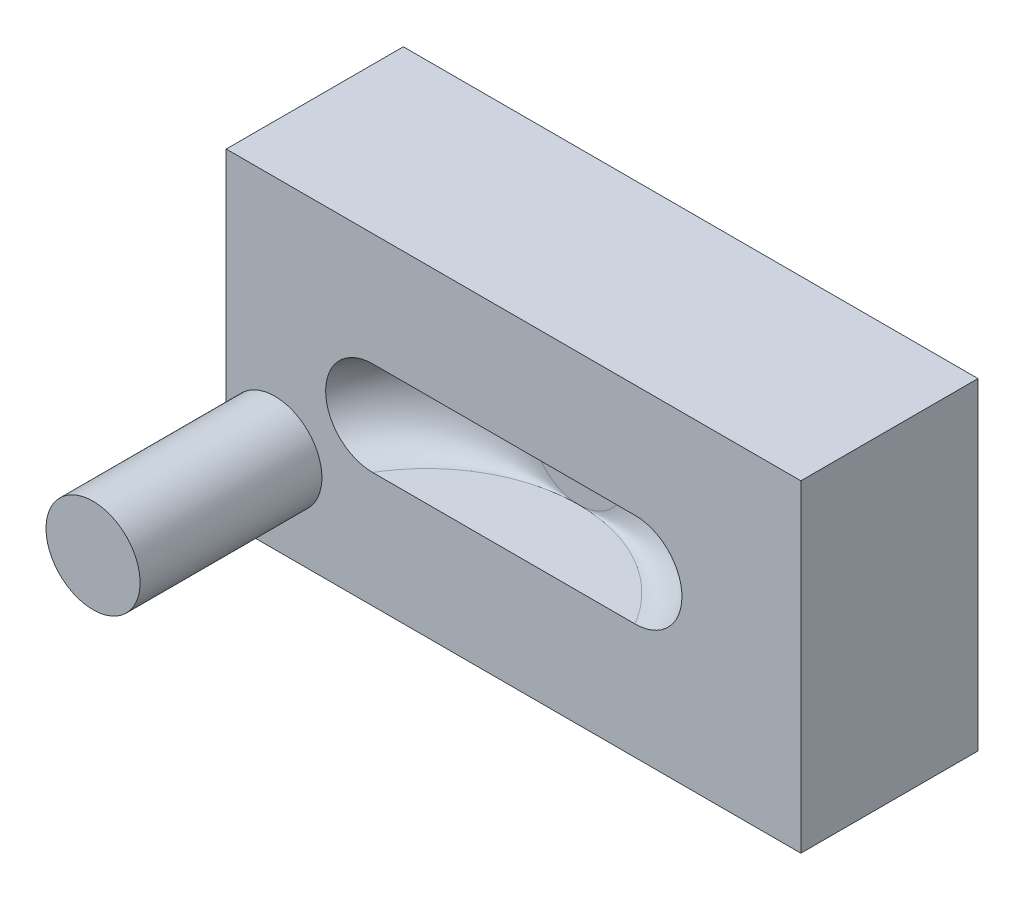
ISO-10303-21;
HEADER;
FILE_DESCRIPTION(('STEP AP214'),'2;1');
FILE_NAME('part.step','',(''),(''),'','','');
FILE_SCHEMA(('AUTOMOTIVE_DESIGN { 1 0 10303 214 1 1 1 1 }'));
ENDSEC;
DATA;
#1=APPLICATION_CONTEXT('core data for automotive mechanical design processes');
#2=APPLICATION_PROTOCOL_DEFINITION('international standard','automotive_design',2000,#1);
#3=PRODUCT_CONTEXT('',#1,'mechanical');
#4=PRODUCT('Part','Part','',(#3));
#5=PRODUCT_RELATED_PRODUCT_CATEGORY('part','',(#4));
#6=PRODUCT_DEFINITION_FORMATION('','',#4);
#7=PRODUCT_DEFINITION_CONTEXT('part definition',#1,'design');
#8=PRODUCT_DEFINITION('design','',#6,#7);
#9=PRODUCT_DEFINITION_SHAPE('','',#8);
#10=(LENGTH_UNIT() NAMED_UNIT(*) SI_UNIT(.MILLI.,.METRE.));
#11=(NAMED_UNIT(*) PLANE_ANGLE_UNIT() SI_UNIT($,.RADIAN.));
#12=(NAMED_UNIT(*) SI_UNIT($,.STERADIAN.) SOLID_ANGLE_UNIT());
#13=UNCERTAINTY_MEASURE_WITH_UNIT(LENGTH_MEASURE(1.E-05),#10,'distance_accuracy_value','');
#14=(GEOMETRIC_REPRESENTATION_CONTEXT(3) GLOBAL_UNCERTAINTY_ASSIGNED_CONTEXT((#13)) GLOBAL_UNIT_ASSIGNED_CONTEXT((#10,
#11,#12)) REPRESENTATION_CONTEXT('',''));
#15=CARTESIAN_POINT('',(0.,0.,0.));
#16=DIRECTION('',(0.,0.,1.));
#17=DIRECTION('',(1.,0.,0.));
#18=AXIS2_PLACEMENT_3D('',#15,#16,#17);
#19=CARTESIAN_POINT('',(-63.6736484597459,0.,185.30228985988));
#20=DIRECTION('',(0.,0.,-1.));
#21=DIRECTION('',(-1.,0.,0.));
#22=AXIS2_PLACEMENT_3D('',#19,#20,#21);
#23=CYLINDRICAL_SURFACE('',#22,20.);
#24=CARTESIAN_POINT('',(-63.6736484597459,0.,185.30228985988));
#25=DIRECTION('',(0.,0.,-1.));
#26=DIRECTION('',(-1.,0.,0.));
#27=AXIS2_PLACEMENT_3D('',#24,#25,#26);
#28=CIRCLE('',#27,20.);
#29=CARTESIAN_POINT('',(-83.6736484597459,0.,185.30228985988));
#30=VERTEX_POINT('',#29);
#31=EDGE_CURVE('E12',#30,#30,#28,.T.);
#32=ORIENTED_EDGE('',*,*,#31,.T.);
#33=EDGE_LOOP('',(#32));
#34=FACE_BOUND('',#33,.T.);
#35=CARTESIAN_POINT('',(-63.6736484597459,0.,108.00228985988));
#36=DIRECTION('',(0.,0.,-1.));
#37=DIRECTION('',(-1.,0.,0.));
#38=AXIS2_PLACEMENT_3D('',#35,#36,#37);
#39=CIRCLE('',#38,20.);
#40=CARTESIAN_POINT('',(-83.6736484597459,0.,108.00228985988));
#41=VERTEX_POINT('',#40);
#42=EDGE_CURVE('E92',#41,#41,#39,.T.);
#43=ORIENTED_EDGE('',*,*,#42,.F.);
#44=EDGE_LOOP('',(#43));
#45=FACE_BOUND('',#44,.T.);
#46=ADVANCED_FACE('F89',(#34,#45),#23,.T.);
#47=CARTESIAN_POINT('',(-63.6736484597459,0.,185.30228985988));
#48=DIRECTION('',(0.,0.,-1.));
#49=DIRECTION('',(-1.,0.,0.));
#50=AXIS2_PLACEMENT_3D('',#47,#48,#49);
#51=PLANE('',#50);
#52=ORIENTED_EDGE('',*,*,#31,.F.);
#53=EDGE_LOOP('',(#52));
#54=FACE_BOUND('',#53,.T.);
#55=ADVANCED_FACE('F104',(#54),#51,.F.);
#56=CARTESIAN_POINT('',(-63.6736484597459,0.,108.00228985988));
#57=DIRECTION('',(0.,0.,-1.));
#58=DIRECTION('',(-1.,0.,0.));
#59=AXIS2_PLACEMENT_3D('',#56,#57,#58);
#60=PLANE('',#59);
#61=ORIENTED_EDGE('',*,*,#42,.T.);
#62=EDGE_LOOP('',(#61));
#63=FACE_BOUND('',#62,.T.);
#64=ADVANCED_FACE('F101',(#63),#60,.T.);
#65=CLOSED_SHELL('',(#46,#55,#64));
#66=MANIFOLD_SOLID_BREP('B2',#65);
#67=CARTESIAN_POINT('',(-117.048178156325,-69.1594311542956,75.3));
#68=DIRECTION('',(0.,0.,1.));
#69=DIRECTION('',(1.,0.,0.));
#70=AXIS2_PLACEMENT_3D('',#67,#68,#69);
#71=PLANE('',#70);
#72=DIRECTION('',(0.,-1.,0.));
#73=VECTOR('',#72,1.);
#74=CARTESIAN_POINT('',(-117.048178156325,67.971124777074,75.3));
#75=LINE('',#74,#73);
#76=CARTESIAN_POINT('',(-117.048178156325,67.971124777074,75.3));
#77=VERTEX_POINT('',#76);
#78=CARTESIAN_POINT('',(-117.048178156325,-69.1594311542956,75.3));
#79=VERTEX_POINT('',#78);
#80=EDGE_CURVE('E364',#77,#79,#75,.T.);
#81=ORIENTED_EDGE('',*,*,#80,.T.);
#82=DIRECTION('',(1.,0.,0.));
#83=VECTOR('',#82,1.);
#84=CARTESIAN_POINT('',(-117.048178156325,-69.1594311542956,75.3));
#85=LINE('',#84,#83);
#86=CARTESIAN_POINT('',(127.267613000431,-69.1594311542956,75.3));
#87=VERTEX_POINT('',#86);
#88=EDGE_CURVE('E494',#79,#87,#85,.T.);
#89=ORIENTED_EDGE('',*,*,#88,.T.);
#90=DIRECTION('',(0.,1.,0.));
#91=VECTOR('',#90,1.);
#92=CARTESIAN_POINT('',(127.267613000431,67.971124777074,75.3));
#93=LINE('',#92,#91);
#94=CARTESIAN_POINT('',(127.267613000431,67.971124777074,75.3));
#95=VERTEX_POINT('',#94);
#96=EDGE_CURVE('E358',#87,#95,#93,.T.);
#97=ORIENTED_EDGE('',*,*,#96,.T.);
#98=DIRECTION('',(-1.,0.,0.));
#99=VECTOR('',#98,1.);
#100=CARTESIAN_POINT('',(-117.048178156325,67.971124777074,75.3));
#101=LINE('',#100,#99);
#102=EDGE_CURVE('E371',#95,#77,#101,.T.);
#103=ORIENTED_EDGE('',*,*,#102,.T.);
#104=EDGE_LOOP('',(#81,#89,#97,#103));
#105=FACE_BOUND('',#104,.T.);
#106=CARTESIAN_POINT('',(36.6952350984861,0.,75.3000000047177));
#107=CARTESIAN_POINT('',(36.6952310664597,-0.561906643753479,75.3000000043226));
#108=CARTESIAN_POINT('',(36.7189252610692,-1.12374712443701,75.3000000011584));
#109=CARTESIAN_POINT('',(36.8135366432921,-2.24362214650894,75.2999999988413));
#110=CARTESIAN_POINT('',(36.8844662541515,-2.80165564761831,75.2999999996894));
#111=CARTESIAN_POINT('',(37.0731665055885,-3.91037332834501,75.300000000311));
#112=CARTESIAN_POINT('',(37.1909889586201,-4.46104867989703,75.3000000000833));
#113=CARTESIAN_POINT('',(37.4726246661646,-5.55047372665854,75.2999999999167));
#114=CARTESIAN_POINT('',(37.6364348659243,-6.08922421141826,75.2999999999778));
#115=CARTESIAN_POINT('',(38.0087992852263,-7.15075904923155,75.3000000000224));
#116=CARTESIAN_POINT('',(38.2173332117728,-7.6735505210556,75.300000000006));
#117=CARTESIAN_POINT('',(38.6777095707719,-8.69971362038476,75.299999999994));
#118=CARTESIAN_POINT('',(38.9295526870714,-9.20308494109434,75.2999999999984));
#119=CARTESIAN_POINT('',(39.4746846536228,-10.186693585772,75.3000000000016));
#120=CARTESIAN_POINT('',(39.7679629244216,-10.6669367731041,75.3000000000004));
#121=CARTESIAN_POINT('',(40.3939278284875,-11.6010112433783,75.2999999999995));
#122=CARTESIAN_POINT('',(40.7266143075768,-12.0548426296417,75.2999999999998));
#123=CARTESIAN_POINT('',(41.429069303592,-12.9329165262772,75.3000000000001));
#124=CARTESIAN_POINT('',(41.7988417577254,-13.3571558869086,75.3));
#125=CARTESIAN_POINT('',(42.5728108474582,-14.1729771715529,75.3));
#126=CARTESIAN_POINT('',(42.9770075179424,-14.5645590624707,75.3));
#127=CARTESIAN_POINT('',(43.8169676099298,-15.3122957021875,75.3));
#128=CARTESIAN_POINT('',(44.2527322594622,-15.6684490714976,75.3));
#129=CARTESIAN_POINT('',(45.152716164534,-16.3427791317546,75.3));
#130=CARTESIAN_POINT('',(45.6169354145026,-16.6609558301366,75.3));
#131=CARTESIAN_POINT('',(46.570519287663,-17.257064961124,75.3));
#132=CARTESIAN_POINT('',(47.0598834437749,-17.5349981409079,75.3));
#133=CARTESIAN_POINT('',(48.0602859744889,-18.0486513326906,75.3));
#134=CARTESIAN_POINT('',(48.5713243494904,-18.2843713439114,75.3));
#135=CARTESIAN_POINT('',(49.6114410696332,-18.7119219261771,75.3));
#136=CARTESIAN_POINT('',(50.1405193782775,-18.9037525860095,75.3));
#137=CARTESIAN_POINT('',(51.2129555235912,-19.2421612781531,75.3));
#138=CARTESIAN_POINT('',(51.7563133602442,-19.3887393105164,75.2999999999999));
#139=CARTESIAN_POINT('',(52.853446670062,-19.6356009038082,75.2999999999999));
#140=CARTESIAN_POINT('',(53.4072221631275,-19.735884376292,75.3));
#141=CARTESIAN_POINT('',(54.5212527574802,-19.8894434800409,75.3));
#142=CARTESIAN_POINT('',(55.0815078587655,-19.9427191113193,75.3));
#143=CARTESIAN_POINT('',(56.2045135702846,-20.0018837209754,75.3));
#144=CARTESIAN_POINT('',(56.7672641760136,-20.0077727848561,75.3));
#145=CARTESIAN_POINT('',(57.8912610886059,-19.9721226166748,75.3));
#146=CARTESIAN_POINT('',(58.4525073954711,-19.9305833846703,75.3));
#147=CARTESIAN_POINT('',(59.5695058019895,-19.8003719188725,75.3));
#148=CARTESIAN_POINT('',(60.1252578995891,-19.7116996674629,75.3));
#149=CARTESIAN_POINT('',(61.227316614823,-19.4878525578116,75.3));
#150=CARTESIAN_POINT('',(61.7736232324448,-19.3526776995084,75.3));
#151=CARTESIAN_POINT('',(62.8529076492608,-19.0367862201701,75.3));
#152=CARTESIAN_POINT('',(63.3858854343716,-18.8560695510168,75.3));
#153=CARTESIAN_POINT('',(64.4347224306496,-18.4503793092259,75.3));
#154=CARTESIAN_POINT('',(64.9505816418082,-18.2254057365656,75.3000000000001));
#155=CARTESIAN_POINT('',(65.9615138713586,-17.732801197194,75.3000000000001));
#156=CARTESIAN_POINT('',(66.4565868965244,-17.4651702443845,75.3));
#157=CARTESIAN_POINT('',(67.4224272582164,-16.8891535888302,75.3));
#158=CARTESIAN_POINT('',(67.8931945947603,-16.5807678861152,75.3));
#159=CARTESIAN_POINT('',(68.807076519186,-15.9254343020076,75.3));
#160=CARTESIAN_POINT('',(69.2501911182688,-15.5784864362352,75.3));
#161=CARTESIAN_POINT('',(70.1056174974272,-14.8484950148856,75.3));
#162=CARTESIAN_POINT('',(70.5179292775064,-14.4654514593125,75.3000000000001));
#163=CARTESIAN_POINT('',(71.3088187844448,-13.6659918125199,75.3000000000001));
#164=CARTESIAN_POINT('',(71.687396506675,-13.2495757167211,75.3));
#165=CARTESIAN_POINT('',(72.4081263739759,-12.3863315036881,75.3));
#166=CARTESIAN_POINT('',(72.7502785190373,-11.9395033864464,75.3));
#167=CARTESIAN_POINT('',(73.3957247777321,-11.018611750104,75.3));
#168=CARTESIAN_POINT('',(73.6990188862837,-10.5445482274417,75.3));
#169=CARTESIAN_POINT('',(74.2645927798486,-9.57255614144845,75.3));
#170=CARTESIAN_POINT('',(74.5268725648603,-9.07462757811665,75.3));
#171=CARTESIAN_POINT('',(75.0085531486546,-8.05844540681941,75.3));
#172=CARTESIAN_POINT('',(75.2279539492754,-7.54019179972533,75.3));
#173=CARTESIAN_POINT('',(75.622316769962,-6.48704399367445,75.3));
#174=CARTESIAN_POINT('',(75.7972787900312,-5.95214979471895,75.3));
#175=CARTESIAN_POINT('',(76.1015201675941,-4.86952360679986,75.3));
#176=CARTESIAN_POINT('',(76.2307995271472,-4.32179161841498,75.3));
#177=CARTESIAN_POINT('',(76.4427564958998,-3.21738387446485,75.3));
#178=CARTESIAN_POINT('',(76.5254341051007,-2.66070811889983,75.3));
#179=CARTESIAN_POINT('',(76.6435997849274,-1.54237047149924,75.3));
#180=CARTESIAN_POINT('',(76.6790878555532,-0.980708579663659,75.3));
#181=CARTESIAN_POINT('',(76.7026221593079,0.143608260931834,75.3));
#182=CARTESIAN_POINT('',(76.6906683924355,0.706263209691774,75.3));
#183=CARTESIAN_POINT('',(76.6194040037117,1.82856605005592,75.3));
#184=CARTESIAN_POINT('',(76.5600933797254,2.38821394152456,75.3));
#185=CARTESIAN_POINT('',(76.3945369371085,3.50052388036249,75.3));
#186=CARTESIAN_POINT('',(76.2882911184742,4.05318592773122,75.3));
#187=CARTESIAN_POINT('',(76.0296196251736,5.14759510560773,75.3));
#188=CARTESIAN_POINT('',(75.8771939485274,5.68934223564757,75.3));
#189=CARTESIAN_POINT('',(75.5272463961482,6.7580700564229,75.3));
#190=CARTESIAN_POINT('',(75.3297245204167,7.28505074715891,75.3));
#191=CARTESIAN_POINT('',(74.8909888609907,8.32049910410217,75.3));
#192=CARTESIAN_POINT('',(74.6497750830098,8.82896677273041,75.3));
#193=CARTESIAN_POINT('',(74.1253704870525,9.82377425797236,75.3));
#194=CARTESIAN_POINT('',(73.8421796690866,10.3101140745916,75.2999999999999));
#195=CARTESIAN_POINT('',(73.2358343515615,11.2572082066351,75.2999999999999));
#196=CARTESIAN_POINT('',(72.9126798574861,11.7179625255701,75.3));
#197=CARTESIAN_POINT('',(72.2287045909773,12.6106100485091,75.3));
#198=CARTESIAN_POINT('',(71.8678838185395,13.0425032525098,75.3));
#199=CARTESIAN_POINT('',(71.1111410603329,13.8743582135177,75.3));
#200=CARTESIAN_POINT('',(70.715219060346,14.2743199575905,75.3));
#201=CARTESIAN_POINT('',(69.8910887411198,15.0394683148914,75.3));
#202=CARTESIAN_POINT('',(69.4628804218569,15.404654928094,75.3));
#203=CARTESIAN_POINT('',(68.577221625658,16.0976568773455,75.3));
#204=CARTESIAN_POINT('',(68.1197711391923,16.4254722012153,75.3));
#205=CARTESIAN_POINT('',(67.1788803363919,17.0414008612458,75.3));
#206=CARTESIAN_POINT('',(66.6954400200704,17.3295141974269,75.3));
#207=CARTESIAN_POINT('',(65.7060070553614,17.863990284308,75.3));
#208=CARTESIAN_POINT('',(65.2000144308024,18.1103530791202,75.3));
#209=CARTESIAN_POINT('',(64.1690736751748,18.5595769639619,75.3));
#210=CARTESIAN_POINT('',(63.6441255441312,18.7624380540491,75.3));
#211=CARTESIAN_POINT('',(62.5790060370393,19.1232162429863,75.3));
#212=CARTESIAN_POINT('',(62.0388346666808,19.2811333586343,75.3));
#213=CARTESIAN_POINT('',(60.9471087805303,19.550901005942,75.3));
#214=CARTESIAN_POINT('',(60.3955542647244,19.6627515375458,75.3));
#215=CARTESIAN_POINT('',(59.2849823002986,19.8395909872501,75.3));
#216=CARTESIAN_POINT('',(58.7259648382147,19.9045798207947,75.3));
#217=CARTESIAN_POINT('',(57.6044422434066,19.9872335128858,75.3));
#218=CARTESIAN_POINT('',(57.0419371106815,20.0048983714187,75.3));
#219=CARTESIAN_POINT('',(55.9174393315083,19.9927785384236,75.3));
#220=CARTESIAN_POINT('',(55.3554466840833,19.9629939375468,75.3));
#221=CARTESIAN_POINT('',(54.2359682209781,19.8561871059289,75.3));
#222=CARTESIAN_POINT('',(53.6784824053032,19.7791648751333,75.3));
#223=CARTESIAN_POINT('',(52.5719798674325,19.5784301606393,75.3));
#224=CARTESIAN_POINT('',(52.0229631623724,19.4547175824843,75.3));
#225=CARTESIAN_POINT('',(50.937303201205,19.1614817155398,75.3));
#226=CARTESIAN_POINT('',(50.4006599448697,18.9919584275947,75.2999999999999));
#227=CARTESIAN_POINT('',(49.3435522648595,18.6083027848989,75.2999999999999));
#228=CARTESIAN_POINT('',(48.8230881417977,18.3941696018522,75.3));
#229=CARTESIAN_POINT('',(47.8020493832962,17.9228184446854,75.3));
#230=CARTESIAN_POINT('',(47.3014747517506,17.6656004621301,75.3));
#231=CARTESIAN_POINT('',(46.3237930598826,17.1099193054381,75.3));
#232=CARTESIAN_POINT('',(45.8466850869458,16.8114577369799,75.3));
#233=CARTESIAN_POINT('',(44.9193081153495,16.1754039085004,75.3));
#234=CARTESIAN_POINT('',(44.4690390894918,15.8378116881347,75.3));
#235=CARTESIAN_POINT('',(43.5985868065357,15.1259341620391,75.3));
#236=CARTESIAN_POINT('',(43.1784003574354,14.7516527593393,75.3));
#237=CARTESIAN_POINT('',(42.3710454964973,13.9690255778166,75.3));
#238=CARTESIAN_POINT('',(41.9838772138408,13.560679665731,75.3000000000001));
#239=CARTESIAN_POINT('',(41.2452181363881,12.7127188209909,75.2999999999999));
#240=CARTESIAN_POINT('',(40.8937364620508,12.2730959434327,75.2999999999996));
#241=CARTESIAN_POINT('',(40.229067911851,11.3658072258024,75.3000000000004));
#242=CARTESIAN_POINT('',(39.9158804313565,10.8981418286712,75.3000000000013));
#243=CARTESIAN_POINT('',(39.3298879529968,9.93786880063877,75.2999999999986));
#244=CARTESIAN_POINT('',(39.0571013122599,9.44524996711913,75.2999999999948));
#245=CARTESIAN_POINT('',(38.5540052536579,8.43874116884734,75.3000000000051));
#246=CARTESIAN_POINT('',(38.3236986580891,7.92484979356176,75.3000000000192));
#247=CARTESIAN_POINT('',(37.9074538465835,6.88005175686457,75.2999999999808));
#248=CARTESIAN_POINT('',(37.721466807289,6.34916455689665,75.2999999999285));
#249=CARTESIAN_POINT('',(37.3949013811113,5.27379187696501,75.3000000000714));
#250=CARTESIAN_POINT('',(37.2543110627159,4.72931001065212,75.3000000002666));
#251=CARTESIAN_POINT('',(36.9902297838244,3.49356595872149,75.2999999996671));
#252=CARTESIAN_POINT('',(36.879700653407,2.79949584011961,75.299999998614));
#253=CARTESIAN_POINT('',(36.7322058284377,1.40358275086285,75.300000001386));
#254=CARTESIAN_POINT('',(36.6952401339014,0.701739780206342,75.3000000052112));
#255=CARTESIAN_POINT('',(36.6952350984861,0.,75.3000000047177));
#256=B_SPLINE_CURVE_WITH_KNOTS('',3,(#106,#107,#108,#109,#110,#111,#112,#113,#114,#115,#116,
#117,#118,#119,#120,#121,#122,#123,#124,#125,#126,#127,#128,#129,#130,#131,#132,#133,#134,#135,
#136,#137,#138,#139,#140,#141,#142,#143,#144,#145,#146,#147,#148,#149,#150,#151,#152,#153,#154,
#155,#156,#157,#158,#159,#160,#161,#162,#163,#164,#165,#166,#167,#168,#169,#170,#171,#172,#173,
#174,#175,#176,#177,#178,#179,#180,#181,#182,#183,#184,#185,#186,#187,#188,#189,#190,#191,#192,
#193,#194,#195,#196,#197,#198,#199,#200,#201,#202,#203,#204,#205,#206,#207,#208,#209,#210,#211,
#212,#213,#214,#215,#216,#217,#218,#219,#220,#221,#222,#223,#224,#225,#226,#227,#228,#229,#230,
#231,#232,#233,#234,#235,#236,#237,#238,#239,#240,#241,#242,#243,#244,#245,#246,#247,#248,#249,
#250,#251,#252,#253,#254,#255),.UNSPECIFIED.,.T.,.F.,(4,2,2,2,2,2,2,2,2,2,2,2,2,2,2,2,2,2,2,2,2,
2,2,2,2,2,2,2,2,2,2,2,2,2,2,2,2,2,2,2,2,2,2,2,2,2,2,2,2,2,2,2,2,2,2,2,2,2,2,2,2,2,2,2,2,2,2,2,2,
2,2,2,2,2,4),(0.,1.68510696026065,3.3706572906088,5.05807519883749,6.74538104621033,
8.43192290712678,10.1184914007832,11.8046300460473,13.4907620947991,15.1770733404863,
16.8633862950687,18.5497648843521,20.2361431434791,21.9224900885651,23.6088370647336,
25.2951806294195,26.9815241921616,28.6678709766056,30.3542177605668,32.0405615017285,
33.7269052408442,35.4132496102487,37.0995939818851,38.7859401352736,40.4722862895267,
42.1586318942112,43.8449774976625,45.5313224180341,47.2176673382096,48.9040124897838,
50.5903576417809,52.2767030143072,53.9630483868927,55.6493936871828,57.3357389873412,
59.0220842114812,60.7084294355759,62.3947746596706,64.0811198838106,65.767465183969,
67.4538104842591,69.1401558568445,70.8265012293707,72.5128463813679,74.1991915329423,
75.8855364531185,77.5718813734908,79.2582269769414,80.9445725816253,82.6309187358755,
84.3172648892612,86.0036092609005,87.689953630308,89.3762973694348,91.0626411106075,
92.7489878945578,94.4353346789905,96.1216782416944,97.8080218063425,99.4943687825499,
101.180715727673,102.86709398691,104.55347257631,106.239785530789,107.926096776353,
109.612228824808,111.298367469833,112.984935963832,114.671477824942,116.358783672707,
118.046201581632,119.731751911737,121.416858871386,123.521312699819,125.625766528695),.UNSPECIFIED.);
#257=CARTESIAN_POINT('',(56.6952350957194,-20.,75.3000000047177));
#258=VERTEX_POINT('',#257);
#259=CARTESIAN_POINT('',(56.6952350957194,20.,75.3000000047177));
#260=VERTEX_POINT('',#259);
#261=EDGE_CURVE('E236',#258,#260,#256,.T.);
#262=ORIENTED_EDGE('',*,*,#261,.F.);
#263=DIRECTION('',(-1.,0.,0.));
#264=VECTOR('',#263,1.);
#265=CARTESIAN_POINT('',(-117.048178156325,-20.,75.3));
#266=LINE('',#265,#264);
#267=CARTESIAN_POINT('',(-54.7885278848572,-20.,75.3));
#268=VERTEX_POINT('',#267);
#269=EDGE_CURVE('E410',#258,#268,#266,.T.);
#270=ORIENTED_EDGE('',*,*,#269,.T.);
#271=CARTESIAN_POINT('',(-74.7885278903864,0.,75.3000000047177));
#272=CARTESIAN_POINT('',(-74.788531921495,-0.561906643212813,75.3000000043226));
#273=CARTESIAN_POINT('',(-74.7648377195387,-1.12374712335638,75.3000000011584));
#274=CARTESIAN_POINT('',(-74.6702263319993,-2.2436221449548,75.2999999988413));
#275=CARTESIAN_POINT('',(-74.599296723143,-2.80165564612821,75.2999999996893));
#276=CARTESIAN_POINT('',(-74.4105964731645,-3.91037332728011,75.300000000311));
#277=CARTESIAN_POINT('',(-74.2927740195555,-4.46104867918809,75.3000000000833));
#278=CARTESIAN_POINT('',(-74.0111383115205,-5.55047372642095,75.2999999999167));
#279=CARTESIAN_POINT('',(-73.8473281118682,-6.08922421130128,75.2999999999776));
#280=CARTESIAN_POINT('',(-73.4749636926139,-7.15075904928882,75.3000000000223));
#281=CARTESIAN_POINT('',(-73.2664297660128,-7.67355052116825,75.300000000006));
#282=CARTESIAN_POINT('',(-72.8060534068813,-8.69971362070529,75.299999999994));
#283=CARTESIAN_POINT('',(-72.5542102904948,-9.2030849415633,75.2999999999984));
#284=CARTESIAN_POINT('',(-72.0090783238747,-10.186693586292,75.3000000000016));
#285=CARTESIAN_POINT('',(-71.7158000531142,-10.6669367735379,75.3000000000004));
#286=CARTESIAN_POINT('',(-71.0898351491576,-11.6010112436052,75.2999999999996));
#287=CARTESIAN_POINT('',(-70.7571486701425,-12.0548426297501,75.2999999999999));
#288=CARTESIAN_POINT('',(-70.0546936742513,-12.9329165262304,75.3000000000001));
#289=CARTESIAN_POINT('',(-69.6849212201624,-13.3571558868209,75.3));
#290=CARTESIAN_POINT('',(-68.9109521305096,-14.1729771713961,75.3));
#291=CARTESIAN_POINT('',(-68.5067554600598,-14.5645590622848,75.3));
#292=CARTESIAN_POINT('',(-67.6667953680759,-15.3122957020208,75.3));
#293=CARTESIAN_POINT('',(-67.2310307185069,-15.6684490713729,75.3));
#294=CARTESIAN_POINT('',(-66.3310468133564,-16.3427791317,75.3));
#295=CARTESIAN_POINT('',(-65.8668275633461,-16.6609558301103,75.3));
#296=CARTESIAN_POINT('',(-64.9132436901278,-17.257064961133,75.3));
#297=CARTESIAN_POINT('',(-64.4238795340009,-17.5349981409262,75.3));
#298=CARTESIAN_POINT('',(-63.4234770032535,-18.0486513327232,75.3));
#299=CARTESIAN_POINT('',(-62.9124386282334,-18.2843713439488,75.3));
#300=CARTESIAN_POINT('',(-61.8723219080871,-18.7119219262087,75.3));
#301=CARTESIAN_POINT('',(-61.3432435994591,-18.9037525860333,75.3));
#302=CARTESIAN_POINT('',(-60.2708074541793,-19.2421612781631,75.3));
#303=CARTESIAN_POINT('',(-59.7274496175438,-19.3887393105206,75.3));
#304=CARTESIAN_POINT('',(-58.6303163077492,-19.6356009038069,75.3));
#305=CARTESIAN_POINT('',(-58.0765408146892,-19.7358843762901,75.3));
#306=CARTESIAN_POINT('',(-56.9625102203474,-19.8894434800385,75.3));
#307=CARTESIAN_POINT('',(-56.4022551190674,-19.942719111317,75.3));
#308=CARTESIAN_POINT('',(-55.2792494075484,-20.0018837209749,75.3));
#309=CARTESIAN_POINT('',(-54.716498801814,-20.0077727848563,75.3));
#310=CARTESIAN_POINT('',(-53.5925018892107,-19.9721226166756,75.3));
#311=CARTESIAN_POINT('',(-53.0312555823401,-19.9305833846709,75.3));
#312=CARTESIAN_POINT('',(-51.914257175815,-19.8003719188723,75.3));
#313=CARTESIAN_POINT('',(-51.358505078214,-19.7116996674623,75.3));
#314=CARTESIAN_POINT('',(-50.2564463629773,-19.4878525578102,75.3));
#315=CARTESIAN_POINT('',(-49.710139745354,-19.3526776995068,75.3));
#316=CARTESIAN_POINT('',(-48.6308553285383,-19.0367862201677,75.3));
#317=CARTESIAN_POINT('',(-48.0978775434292,-18.8560695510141,75.3));
#318=CARTESIAN_POINT('',(-47.0490405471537,-18.4503793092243,75.3));
#319=CARTESIAN_POINT('',(-46.5331813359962,-18.2254057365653,75.3));
#320=CARTESIAN_POINT('',(-45.5222491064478,-17.7328011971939,75.3));
#321=CARTESIAN_POINT('',(-45.027176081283,-17.4651702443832,75.3));
#322=CARTESIAN_POINT('',(-44.0613357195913,-16.8891535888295,75.3));
#323=CARTESIAN_POINT('',(-43.5905683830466,-16.5807678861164,75.3));
#324=CARTESIAN_POINT('',(-42.6766864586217,-15.9254343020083,75.3));
#325=CARTESIAN_POINT('',(-42.2335718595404,-15.5784864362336,75.3));
#326=CARTESIAN_POINT('',(-41.378145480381,-14.8484950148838,75.3));
#327=CARTESIAN_POINT('',(-40.9658337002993,-14.4654514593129,75.3));
#328=CARTESIAN_POINT('',(-40.1749441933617,-13.6659918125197,75.3));
#329=CARTESIAN_POINT('',(-39.7963664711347,-13.2495757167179,75.3));
#330=CARTESIAN_POINT('',(-39.0756366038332,-12.386331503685,75.3));
#331=CARTESIAN_POINT('',(-38.7334844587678,-11.9395033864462,75.3));
#332=CARTESIAN_POINT('',(-38.0880382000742,-11.0186117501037,75.3));
#333=CARTESIAN_POINT('',(-37.7847440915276,-10.5445482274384,75.3));
#334=CARTESIAN_POINT('',(-37.2191701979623,-9.57255614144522,75.3));
#335=CARTESIAN_POINT('',(-36.9568904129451,-9.07462757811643,75.3));
#336=CARTESIAN_POINT('',(-36.4752098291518,-8.0584454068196,75.3));
#337=CARTESIAN_POINT('',(-36.2558090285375,-7.54019179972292,75.3));
#338=CARTESIAN_POINT('',(-35.8614462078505,-6.4870439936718,75.3));
#339=CARTESIAN_POINT('',(-35.6864841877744,-5.95214979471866,75.3));
#340=CARTESIAN_POINT('',(-35.3822428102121,-4.86952360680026,75.3));
#341=CARTESIAN_POINT('',(-35.2529634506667,-4.32179161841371,75.3));
#342=CARTESIAN_POINT('',(-35.0410064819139,-3.21738387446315,75.3));
#343=CARTESIAN_POINT('',(-34.9583288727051,-2.66070811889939,75.3));
#344=CARTESIAN_POINT('',(-34.8401631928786,-1.54237047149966,75.3));
#345=CARTESIAN_POINT('',(-34.804675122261,-0.980708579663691,75.3));
#346=CARTESIAN_POINT('',(-34.7811408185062,0.143608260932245,75.3));
#347=CARTESIAN_POINT('',(-34.7930945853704,0.706263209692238,75.3));
#348=CARTESIAN_POINT('',(-34.8643589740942,1.82856605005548,75.3));
#349=CARTESIAN_POINT('',(-34.9236695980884,2.38821394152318,75.3));
#350=CARTESIAN_POINT('',(-35.0892260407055,3.50052388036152,75.3));
#351=CARTESIAN_POINT('',(-35.195471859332,4.05318592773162,75.3));
#352=CARTESIAN_POINT('',(-35.4541433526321,5.1475951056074,75.3));
#353=CARTESIAN_POINT('',(-35.6065690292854,5.68934223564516,75.3));
#354=CARTESIAN_POINT('',(-35.956516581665,6.75807005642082,75.3));
#355=CARTESIAN_POINT('',(-36.1540384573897,7.28505074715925,75.3));
#356=CARTESIAN_POINT('',(-36.5927741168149,8.32049910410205,75.3));
#357=CARTESIAN_POINT('',(-36.8339878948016,8.82896677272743,75.3));
#358=CARTESIAN_POINT('',(-37.3583924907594,9.82377425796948,75.3));
#359=CARTESIAN_POINT('',(-37.6415833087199,10.3101140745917,75.3));
#360=CARTESIAN_POINT('',(-38.2479286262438,11.257208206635,75.3));
#361=CARTESIAN_POINT('',(-38.5710831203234,11.7179625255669,75.3));
#362=CARTESIAN_POINT('',(-39.2550583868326,12.6106100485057,75.3));
#363=CARTESIAN_POINT('',(-39.6158791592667,13.0425032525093,75.3));
#364=CARTESIAN_POINT('',(-40.3726219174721,13.8743582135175,75.3));
#365=CARTESIAN_POINT('',(-40.7685439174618,14.2743199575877,75.3));
#366=CARTESIAN_POINT('',(-41.5926742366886,15.0394683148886,75.3));
#367=CARTESIAN_POINT('',(-42.0208825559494,15.4046549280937,75.2999999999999));
#368=CARTESIAN_POINT('',(-42.9065413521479,16.0976568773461,75.2999999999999));
#369=CARTESIAN_POINT('',(-43.3639918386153,16.4254722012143,75.3));
#370=CARTESIAN_POINT('',(-44.304882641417,17.0414008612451,75.3));
#371=CARTESIAN_POINT('',(-44.7883229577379,17.3295141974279,75.3));
#372=CARTESIAN_POINT('',(-45.7777559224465,17.8639902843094,75.3));
#373=CARTESIAN_POINT('',(-46.2837485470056,18.1103530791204,75.3));
#374=CARTESIAN_POINT('',(-47.3146893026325,18.5595769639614,75.3));
#375=CARTESIAN_POINT('',(-47.8396374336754,18.7624380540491,75.3));
#376=CARTESIAN_POINT('',(-48.9047569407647,19.1232162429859,75.3));
#377=CARTESIAN_POINT('',(-49.4449283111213,19.281133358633,75.3));
#378=CARTESIAN_POINT('',(-50.536654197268,19.55090100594,75.3));
#379=CARTESIAN_POINT('',(-51.0882087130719,19.6627515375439,75.3));
#380=CARTESIAN_POINT('',(-52.1987806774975,19.8395909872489,75.3));
#381=CARTESIAN_POINT('',(-52.7577981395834,19.904579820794,75.3));
#382=CARTESIAN_POINT('',(-53.8793207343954,19.9872335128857,75.3));
#383=CARTESIAN_POINT('',(-54.4418258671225,20.0048983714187,75.3000000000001));
#384=CARTESIAN_POINT('',(-55.5663236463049,19.9927785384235,75.3000000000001));
#385=CARTESIAN_POINT('',(-56.1283162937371,19.9629939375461,75.3));
#386=CARTESIAN_POINT('',(-57.2477947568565,19.8561871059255,75.3));
#387=CARTESIAN_POINT('',(-57.8052805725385,19.779164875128,75.3));
#388=CARTESIAN_POINT('',(-58.9117831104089,19.5784301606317,75.3));
#389=CARTESIAN_POINT('',(-59.4607998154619,19.4547175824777,75.3));
#390=CARTESIAN_POINT('',(-60.5464597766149,19.1614817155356,75.3));
#391=CARTESIAN_POINT('',(-61.083103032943,18.9919584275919,75.3000000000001));
#392=CARTESIAN_POINT('',(-62.1402107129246,18.6083027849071,75.3000000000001));
#393=CARTESIAN_POINT('',(-62.6606748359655,18.394169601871,75.3));
#394=CARTESIAN_POINT('',(-63.6817135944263,17.9228184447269,75.3));
#395=CARTESIAN_POINT('',(-64.1822882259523,17.6656004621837,75.3));
#396=CARTESIAN_POINT('',(-65.1599699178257,17.1099193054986,75.3));
#397=CARTESIAN_POINT('',(-65.6370778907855,16.8114577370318,75.3));
#398=CARTESIAN_POINT('',(-66.5644548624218,16.175403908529,75.3));
#399=CARTESIAN_POINT('',(-67.0147238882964,15.8378116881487,75.3));
#400=CARTESIAN_POINT('',(-67.8851761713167,15.1259341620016,75.2999999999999));
#401=CARTESIAN_POINT('',(-68.3053626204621,14.7516527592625,75.3));
#402=CARTESIAN_POINT('',(-69.1127174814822,13.9690255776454,75.3));
#403=CARTESIAN_POINT('',(-69.4998857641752,13.5606796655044,75.3000000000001));
#404=CARTESIAN_POINT('',(-70.2385448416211,12.712718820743,75.2999999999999));
#405=CARTESIAN_POINT('',(-70.5900265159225,12.2730959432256,75.2999999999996));
#406=CARTESIAN_POINT('',(-71.2546950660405,11.3658072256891,75.3000000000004));
#407=CARTESIAN_POINT('',(-71.5678825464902,10.8981418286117,75.3000000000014));
#408=CARTESIAN_POINT('',(-72.1538750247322,9.93786880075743,75.2999999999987));
#409=CARTESIAN_POINT('',(-72.4266616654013,9.44524996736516,75.2999999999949));
#410=CARTESIAN_POINT('',(-72.9297577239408,8.43874116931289,75.3000000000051));
#411=CARTESIAN_POINT('',(-73.1600643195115,7.9248497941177,75.3000000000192));
#412=CARTESIAN_POINT('',(-73.5763091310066,6.88005175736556,75.2999999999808));
#413=CARTESIAN_POINT('',(-73.7622961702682,6.34916455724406,75.2999999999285));
#414=CARTESIAN_POINT('',(-74.0888615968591,5.27379187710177,75.3000000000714));
#415=CARTESIAN_POINT('',(-74.229451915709,4.72931001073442,75.3000000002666));
#416=CARTESIAN_POINT('',(-74.4935331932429,3.49356595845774,75.2999999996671));
#417=CARTESIAN_POINT('',(-74.6040623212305,2.79949583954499,75.299999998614));
#418=CARTESIAN_POINT('',(-74.7515571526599,1.40358275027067,75.300000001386));
#419=CARTESIAN_POINT('',(-74.7885228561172,0.701739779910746,75.3000000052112));
#420=CARTESIAN_POINT('',(-74.7885278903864,0.,75.3000000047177));
#421=B_SPLINE_CURVE_WITH_KNOTS('',3,(#271,#272,#273,#274,#275,#276,#277,#278,#279,#280,#281,
#282,#283,#284,#285,#286,#287,#288,#289,#290,#291,#292,#293,#294,#295,#296,#297,#298,#299,#300,
#301,#302,#303,#304,#305,#306,#307,#308,#309,#310,#311,#312,#313,#314,#315,#316,#317,#318,#319,
#320,#321,#322,#323,#324,#325,#326,#327,#328,#329,#330,#331,#332,#333,#334,#335,#336,#337,#338,
#339,#340,#341,#342,#343,#344,#345,#346,#347,#348,#349,#350,#351,#352,#353,#354,#355,#356,#357,
#358,#359,#360,#361,#362,#363,#364,#365,#366,#367,#368,#369,#370,#371,#372,#373,#374,#375,#376,
#377,#378,#379,#380,#381,#382,#383,#384,#385,#386,#387,#388,#389,#390,#391,#392,#393,#394,#395,
#396,#397,#398,#399,#400,#401,#402,#403,#404,#405,#406,#407,#408,#409,#410,#411,#412,#413,#414,
#415,#416,#417,#418,#419,#420),.UNSPECIFIED.,.T.,.F.,(4,2,2,2,2,2,2,2,2,2,2,2,2,2,2,2,2,2,2,2,2,
2,2,2,2,2,2,2,2,2,2,2,2,2,2,2,2,2,2,2,2,2,2,2,2,2,2,2,2,2,2,2,2,2,2,2,2,2,2,2,2,2,2,2,2,2,2,2,2,
2,2,2,2,2,4),(0.,1.68510695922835,3.37065728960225,5.05807519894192,6.74538104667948,
8.43192290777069,10.1184914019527,11.8046300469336,13.4907620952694,15.1770733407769,
16.8633862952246,18.5497648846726,20.2361431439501,21.9224900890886,23.6088370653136,
25.2951806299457,26.9815241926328,28.6678709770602,30.3542177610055,32.0405615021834,
33.7269052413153,35.4132496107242,37.0995939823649,38.7859401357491,40.4722862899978,
42.1586318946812,43.8449774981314,45.5313224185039,47.2176673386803,48.9040124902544,
50.5903576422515,52.2767030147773,53.9630483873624,55.6493936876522,57.3357389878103,
59.0220842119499,60.7084294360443,62.3947746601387,64.0811198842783,65.7674651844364,
67.4538104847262,69.1401558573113,70.8265012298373,72.5128463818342,74.1991915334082,
75.8855364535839,77.5718813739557,79.2582269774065,80.9445725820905,82.6309187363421,
84.3172648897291,86.003609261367,87.689953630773,89.3762973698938,91.0626411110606,
92.7489878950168,94.4353346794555,96.1216782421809,97.8080218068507,99.4943687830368,
101.180715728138,102.867093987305,104.553472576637,106.239785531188,107.926096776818,
109.612228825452,111.298367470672,112.98493596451,114.671477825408,116.358783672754,
118.046201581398,119.731751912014,121.416858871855,123.521312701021,125.625766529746),.UNSPECIFIED.);
#422=CARTESIAN_POINT('',(-54.7885278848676,20.,75.3));
#423=VERTEX_POINT('',#422);
#424=EDGE_CURVE('E256',#423,#268,#421,.T.);
#425=ORIENTED_EDGE('',*,*,#424,.F.);
#426=DIRECTION('',(-1.,0.,0.));
#427=VECTOR('',#426,1.);
#428=CARTESIAN_POINT('',(-117.048178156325,20.,75.3));
#429=LINE('',#428,#427);
#430=EDGE_CURVE('E462',#260,#423,#429,.T.);
#431=ORIENTED_EDGE('',*,*,#430,.F.);
#432=EDGE_LOOP('',(#262,#270,#425,#431));
#433=FACE_BOUND('',#432,.T.);
#434=ADVANCED_FACE('F130',(#105,#433),#71,.T.);
#435=CARTESIAN_POINT('',(-117.048178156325,67.971124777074,75.3));
#436=DIRECTION('',(1.,0.,0.));
#437=DIRECTION('',(0.,0.,-1.));
#438=AXIS2_PLACEMENT_3D('',#435,#436,#437);
#439=PLANE('',#438);
#440=DIRECTION('',(0.,-1.,0.));
#441=VECTOR('',#440,1.);
#442=CARTESIAN_POINT('',(-117.048178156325,67.971124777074,0.));
#443=LINE('',#442,#441);
#444=CARTESIAN_POINT('',(-117.048178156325,67.971124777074,0.));
#445=VERTEX_POINT('',#444);
#446=CARTESIAN_POINT('',(-117.048178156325,-69.1594311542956,0.));
#447=VERTEX_POINT('',#446);
#448=EDGE_CURVE('E354',#445,#447,#443,.T.);
#449=ORIENTED_EDGE('',*,*,#448,.T.);
#450=DIRECTION('',(0.,0.,-1.));
#451=VECTOR('',#450,1.);
#452=CARTESIAN_POINT('',(-117.048178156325,-69.1594311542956,75.3));
#453=LINE('',#452,#451);
#454=EDGE_CURVE('E349',#79,#447,#453,.T.);
#455=ORIENTED_EDGE('',*,*,#454,.F.);
#456=ORIENTED_EDGE('',*,*,#80,.F.);
#457=DIRECTION('',(0.,0.,-1.));
#458=VECTOR('',#457,1.);
#459=CARTESIAN_POINT('',(-117.048178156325,67.971124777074,75.3));
#460=LINE('',#459,#458);
#461=EDGE_CURVE('E368',#77,#445,#460,.T.);
#462=ORIENTED_EDGE('',*,*,#461,.T.);
#463=EDGE_LOOP('',(#449,#455,#456,#462));
#464=FACE_BOUND('',#463,.T.);
#465=ADVANCED_FACE('F132',(#464),#439,.F.);
#466=CARTESIAN_POINT('',(-117.048178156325,-69.1594311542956,75.3));
#467=DIRECTION('',(0.,1.,0.));
#468=DIRECTION('',(0.,0.,1.));
#469=AXIS2_PLACEMENT_3D('',#466,#467,#468);
#470=PLANE('',#469);
#471=DIRECTION('',(1.,0.,0.));
#472=VECTOR('',#471,1.);
#473=CARTESIAN_POINT('',(-117.048178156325,-69.1594311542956,0.));
#474=LINE('',#473,#472);
#475=CARTESIAN_POINT('',(127.267613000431,-69.1594311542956,0.));
#476=VERTEX_POINT('',#475);
#477=EDGE_CURVE('E344',#447,#476,#474,.T.);
#478=ORIENTED_EDGE('',*,*,#477,.T.);
#479=DIRECTION('',(0.,0.,-1.));
#480=VECTOR('',#479,1.);
#481=CARTESIAN_POINT('',(127.267613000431,-69.1594311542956,75.3));
#482=LINE('',#481,#480);
#483=EDGE_CURVE('E346',#87,#476,#482,.T.);
#484=ORIENTED_EDGE('',*,*,#483,.F.);
#485=ORIENTED_EDGE('',*,*,#88,.F.);
#486=ORIENTED_EDGE('',*,*,#454,.T.);
#487=EDGE_LOOP('',(#478,#484,#485,#486));
#488=FACE_BOUND('',#487,.T.);
#489=ADVANCED_FACE('F334',(#488),#470,.F.);
#490=CARTESIAN_POINT('',(127.267613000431,67.971124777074,75.3));
#491=DIRECTION('',(-1.,0.,0.));
#492=DIRECTION('',(0.,0.,1.));
#493=AXIS2_PLACEMENT_3D('',#490,#491,#492);
#494=PLANE('',#493);
#495=DIRECTION('',(0.,1.,0.));
#496=VECTOR('',#495,1.);
#497=CARTESIAN_POINT('',(127.267613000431,67.971124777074,0.));
#498=LINE('',#497,#496);
#499=CARTESIAN_POINT('',(127.267613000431,67.971124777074,0.));
#500=VERTEX_POINT('',#499);
#501=EDGE_CURVE('E353',#476,#500,#498,.T.);
#502=ORIENTED_EDGE('',*,*,#501,.T.);
#503=DIRECTION('',(0.,0.,-1.));
#504=VECTOR('',#503,1.);
#505=CARTESIAN_POINT('',(127.267613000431,67.971124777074,75.3));
#506=LINE('',#505,#504);
#507=EDGE_CURVE('E359',#95,#500,#506,.T.);
#508=ORIENTED_EDGE('',*,*,#507,.F.);
#509=ORIENTED_EDGE('',*,*,#96,.F.);
#510=ORIENTED_EDGE('',*,*,#483,.T.);
#511=EDGE_LOOP('',(#502,#508,#509,#510));
#512=FACE_BOUND('',#511,.T.);
#513=ADVANCED_FACE('F331',(#512),#494,.F.);
#514=CARTESIAN_POINT('',(-117.048178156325,67.971124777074,75.3));
#515=DIRECTION('',(0.,-1.,0.));
#516=DIRECTION('',(0.,0.,-1.));
#517=AXIS2_PLACEMENT_3D('',#514,#515,#516);
#518=PLANE('',#517);
#519=DIRECTION('',(-1.,0.,0.));
#520=VECTOR('',#519,1.);
#521=CARTESIAN_POINT('',(-117.048178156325,67.971124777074,0.));
#522=LINE('',#521,#520);
#523=EDGE_CURVE('E362',#500,#445,#522,.T.);
#524=ORIENTED_EDGE('',*,*,#523,.T.);
#525=ORIENTED_EDGE('',*,*,#461,.F.);
#526=ORIENTED_EDGE('',*,*,#102,.F.);
#527=ORIENTED_EDGE('',*,*,#507,.T.);
#528=EDGE_LOOP('',(#524,#525,#526,#527));
#529=FACE_BOUND('',#528,.T.);
#530=ADVANCED_FACE('F327',(#529),#518,.F.);
#531=CARTESIAN_POINT('',(-117.048178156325,-69.1594311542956,0.));
#532=DIRECTION('',(0.,0.,1.));
#533=DIRECTION('',(1.,0.,0.));
#534=AXIS2_PLACEMENT_3D('',#531,#532,#533);
#535=PLANE('',#534);
#536=ORIENTED_EDGE('',*,*,#448,.F.);
#537=ORIENTED_EDGE('',*,*,#523,.F.);
#538=ORIENTED_EDGE('',*,*,#501,.F.);
#539=ORIENTED_EDGE('',*,*,#477,.F.);
#540=EDGE_LOOP('',(#536,#537,#538,#539));
#541=FACE_BOUND('',#540,.T.);
#542=ADVANCED_FACE('F323',(#541),#535,.F.);
#543=CARTESIAN_POINT('',(0.953353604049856,0.,43.3752877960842));
#544=DIRECTION('',(0.,0.,-1.));
#545=DIRECTION('',(-1.,0.,0.));
#546=AXIS2_PLACEMENT_3D('',#543,#544,#545);
#547=PLANE('',#546);
#548=CARTESIAN_POINT('',(0.953353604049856,0.,43.3752877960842));
#549=DIRECTION('',(0.,0.,-1.));
#550=DIRECTION('',(-1.,0.,0.));
#551=AXIS2_PLACEMENT_3D('',#548,#549,#550);
#552=CIRCLE('',#551,20.);
#553=CARTESIAN_POINT('',(0.961065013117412,-19.9999985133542,43.3752877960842));
#554=VERTEX_POINT('',#553);
#555=CARTESIAN_POINT('',(0.945642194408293,-20.,43.3752882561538));
#556=VERTEX_POINT('',#555);
#557=EDGE_CURVE('E147',#554,#556,#552,.T.);
#558=ORIENTED_EDGE('',*,*,#557,.F.);
#559=CARTESIAN_POINT('',(0.953353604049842,0.,43.3752877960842));
#560=DIRECTION('',(0.,0.,1.));
#561=DIRECTION('',(0.,-1.,0.));
#562=AXIS2_PLACEMENT_3D('',#559,#560,#561);
#563=CIRCLE('',#562,20.);
#564=CARTESIAN_POINT('',(0.961065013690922,20.,43.3752882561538));
#565=VERTEX_POINT('',#564);
#566=EDGE_CURVE('E276',#554,#565,#563,.T.);
#567=ORIENTED_EDGE('',*,*,#566,.T.);
#568=CARTESIAN_POINT('',(0.953353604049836,20.,43.3752877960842));
#569=VERTEX_POINT('',#568);
#570=EDGE_CURVE('E486',#565,#569,#563,.T.);
#571=ORIENTED_EDGE('',*,*,#570,.T.);
#572=DIRECTION('',(-1.,0.,0.));
#573=VECTOR('',#572,1.);
#574=CARTESIAN_POINT('',(0.95335360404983,20.,43.3752877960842));
#575=LINE('',#574,#573);
#576=CARTESIAN_POINT('',(0.945642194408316,20.,43.3752882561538));
#577=VERTEX_POINT('',#576);
#578=EDGE_CURVE('E458',#569,#577,#575,.T.);
#579=ORIENTED_EDGE('',*,*,#578,.T.);
#580=EDGE_CURVE('E313',#556,#577,#552,.T.);
#581=ORIENTED_EDGE('',*,*,#580,.F.);
#582=EDGE_LOOP('',(#558,#567,#571,#579,#581));
#583=FACE_BOUND('',#582,.T.);
#584=ADVANCED_FACE('F322',(#583),#547,.F.);
#585=CARTESIAN_POINT('',(-83.6736484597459,0.,108.00228985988));
#586=CARTESIAN_POINT('',(-83.6736484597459,0.,104.194107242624));
#587=CARTESIAN_POINT('',(-83.335109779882,0.,100.243512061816));
#588=CARTESIAN_POINT('',(-82.5058782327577,0.,95.7624494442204));
#589=CARTESIAN_POINT('',(-81.7171155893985,0.,91.7555558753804));
#590=CARTESIAN_POINT('',(-80.521841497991,0.,87.7138025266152));
#591=CARTESIAN_POINT('',(-78.7581410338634,0.,83.2587858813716));
#592=CARTESIAN_POINT('',(-77.0797414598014,0.,79.2989503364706));
#593=CARTESIAN_POINT('',(-74.9749437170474,0.,75.4457278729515));
#594=CARTESIAN_POINT('',(-72.2695738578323,0.,71.307675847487));
#595=CARTESIAN_POINT('',(-69.7070051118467,0.,67.6887718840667));
#596=CARTESIAN_POINT('',(-66.7639109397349,0.,64.3231715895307));
#597=CARTESIAN_POINT('',(-63.2305329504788,0.,60.7897936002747));
#598=CARTESIAN_POINT('',(-59.9176322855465,0.,57.7937725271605));
#599=CARTESIAN_POINT('',(-56.3324106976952,0.,55.1658438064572));
#600=CARTESIAN_POINT('',(-53.0810841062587,0.,53.0401960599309));
#601=CARTESIAN_POINT('',(-49.3113001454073,0.,50.7718661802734));
#602=CARTESIAN_POINT('',(-45.3812277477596,0.,48.9206882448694));
#603=CARTESIAN_POINT('',(-41.8808575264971,0.,47.5349235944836));
#604=CARTESIAN_POINT('',(-37.8856932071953,0.,46.0636797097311));
#605=CARTESIAN_POINT('',(-33.8470940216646,0.,45.0169046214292));
#606=CARTESIAN_POINT('',(-30.3262591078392,0.,44.3653655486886));
#607=CARTESIAN_POINT('',(-26.3313527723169,0.,43.6732018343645));
#608=CARTESIAN_POINT('',(-22.3978470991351,0.,43.3752877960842));
#609=CARTESIAN_POINT('',(-19.0466463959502,0.,43.3752877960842));
#610=CARTESIAN_POINT('',(-83.6736484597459,40.,108.00228985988));
#611=CARTESIAN_POINT('',(-83.6736484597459,40.,104.194107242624));
#612=CARTESIAN_POINT('',(-83.335109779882,40.,100.243512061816));
#613=CARTESIAN_POINT('',(-82.5058782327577,40.,95.7624494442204));
#614=CARTESIAN_POINT('',(-81.7171155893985,40.,91.7555558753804));
#615=CARTESIAN_POINT('',(-80.5218414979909,40.,87.7138025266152));
#616=CARTESIAN_POINT('',(-78.7581410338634,40.,83.2587858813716));
#617=CARTESIAN_POINT('',(-77.0797414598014,40.,79.2989503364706));
#618=CARTESIAN_POINT('',(-74.9749437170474,40.,75.4457278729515));
#619=CARTESIAN_POINT('',(-72.2695738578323,40.,71.307675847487));
#620=CARTESIAN_POINT('',(-69.7070051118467,40.,67.6887718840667));
#621=CARTESIAN_POINT('',(-66.7639109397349,40.,64.3231715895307));
#622=CARTESIAN_POINT('',(-63.2305329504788,40.,60.7897936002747));
#623=CARTESIAN_POINT('',(-59.9176322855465,40.,57.7937725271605));
#624=CARTESIAN_POINT('',(-56.3324106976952,40.,55.1658438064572));
#625=CARTESIAN_POINT('',(-53.0810841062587,40.,53.0401960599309));
#626=CARTESIAN_POINT('',(-49.3113001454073,40.,50.7718661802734));
#627=CARTESIAN_POINT('',(-45.3812277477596,40.,48.9206882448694));
#628=CARTESIAN_POINT('',(-41.8808575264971,40.,47.5349235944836));
#629=CARTESIAN_POINT('',(-37.8856932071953,40.,46.0636797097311));
#630=CARTESIAN_POINT('',(-33.8470940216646,40.,45.0169046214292));
#631=CARTESIAN_POINT('',(-30.3262591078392,40.,44.3653655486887));
#632=CARTESIAN_POINT('',(-26.3313527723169,40.,43.6732018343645));
#633=CARTESIAN_POINT('',(-22.3978470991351,40.,43.3752877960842));
#634=CARTESIAN_POINT('',(-19.0466463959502,40.,43.3752877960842));
#635=CARTESIAN_POINT('',(-43.6736484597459,40.,108.00228985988));
#636=CARTESIAN_POINT('',(-43.6736484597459,40.,104.194107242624));
#637=CARTESIAN_POINT('',(-43.3351097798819,40.,100.243512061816));
#638=CARTESIAN_POINT('',(-42.5058782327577,40.,95.7624494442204));
#639=CARTESIAN_POINT('',(-41.7171155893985,40.,91.7555558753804));
#640=CARTESIAN_POINT('',(-40.5218414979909,40.,87.7138025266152));
#641=CARTESIAN_POINT('',(-38.7581410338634,40.,83.2587858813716));
#642=CARTESIAN_POINT('',(-37.0797414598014,40.,79.2989503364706));
#643=CARTESIAN_POINT('',(-34.9749437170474,40.,75.4457278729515));
#644=CARTESIAN_POINT('',(-32.2695738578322,40.,71.307675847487));
#645=CARTESIAN_POINT('',(-29.7070051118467,40.,67.6887718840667));
#646=CARTESIAN_POINT('',(-26.7639109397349,40.,64.3231715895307));
#647=CARTESIAN_POINT('',(-23.2305329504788,40.,60.7897936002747));
#648=CARTESIAN_POINT('',(-19.9176322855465,40.,57.7937725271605));
#649=CARTESIAN_POINT('',(-16.3324106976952,40.,55.1658438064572));
#650=CARTESIAN_POINT('',(-13.0810841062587,40.,53.0401960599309));
#651=CARTESIAN_POINT('',(-9.31130014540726,40.,50.7718661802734));
#652=CARTESIAN_POINT('',(-5.38122774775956,40.,48.9206882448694));
#653=CARTESIAN_POINT('',(-1.88085752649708,40.,47.5349235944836));
#654=CARTESIAN_POINT('',(2.11430679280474,40.,46.0636797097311));
#655=CARTESIAN_POINT('',(6.15290597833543,40.,45.0169046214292));
#656=CARTESIAN_POINT('',(9.67374089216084,40.,44.3653655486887));
#657=CARTESIAN_POINT('',(13.6686472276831,40.,43.6732018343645));
#658=CARTESIAN_POINT('',(17.6021529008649,40.,43.3752877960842));
#659=CARTESIAN_POINT('',(20.9533536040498,40.,43.3752877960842));
#660=CARTESIAN_POINT('',(-43.6736484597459,0.,108.00228985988));
#661=CARTESIAN_POINT('',(-43.6736484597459,0.,104.194107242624));
#662=CARTESIAN_POINT('',(-43.3351097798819,0.,100.243512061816));
#663=CARTESIAN_POINT('',(-42.5058782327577,0.,95.7624494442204));
#664=CARTESIAN_POINT('',(-41.7171155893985,0.,91.7555558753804));
#665=CARTESIAN_POINT('',(-40.5218414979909,0.,87.7138025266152));
#666=CARTESIAN_POINT('',(-38.7581410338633,0.,83.2587858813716));
#667=CARTESIAN_POINT('',(-37.0797414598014,0.,79.2989503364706));
#668=CARTESIAN_POINT('',(-34.9749437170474,0.,75.4457278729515));
#669=CARTESIAN_POINT('',(-32.2695738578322,0.,71.307675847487));
#670=CARTESIAN_POINT('',(-29.7070051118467,0.,67.6887718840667));
#671=CARTESIAN_POINT('',(-26.7639109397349,0.,64.3231715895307));
#672=CARTESIAN_POINT('',(-23.2305329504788,0.,60.7897936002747));
#673=CARTESIAN_POINT('',(-19.9176322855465,0.,57.7937725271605));
#674=CARTESIAN_POINT('',(-16.3324106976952,0.,55.1658438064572));
#675=CARTESIAN_POINT('',(-13.0810841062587,0.,53.0401960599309));
#676=CARTESIAN_POINT('',(-9.31130014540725,0.,50.7718661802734));
#677=CARTESIAN_POINT('',(-5.38122774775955,0.,48.9206882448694));
#678=CARTESIAN_POINT('',(-1.88085752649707,0.,47.5349235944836));
#679=CARTESIAN_POINT('',(2.11430679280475,0.,46.0636797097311));
#680=CARTESIAN_POINT('',(6.15290597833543,0.,45.0169046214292));
#681=CARTESIAN_POINT('',(9.67374089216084,0.,44.3653655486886));
#682=CARTESIAN_POINT('',(13.6686472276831,0.,43.6732018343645));
#683=CARTESIAN_POINT('',(17.6021529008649,0.,43.3752877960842));
#684=CARTESIAN_POINT('',(20.9533536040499,0.,43.3752877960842));
#685=CARTESIAN_POINT('',(-43.6736484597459,-40.,108.00228985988));
#686=CARTESIAN_POINT('',(-43.6736484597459,-40.,104.194107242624));
#687=CARTESIAN_POINT('',(-43.3351097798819,-40.,100.243512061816));
#688=CARTESIAN_POINT('',(-42.5058782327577,-40.,95.7624494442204));
#689=CARTESIAN_POINT('',(-41.7171155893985,-40.,91.7555558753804));
#690=CARTESIAN_POINT('',(-40.5218414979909,-40.,87.7138025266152));
#691=CARTESIAN_POINT('',(-38.7581410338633,-40.,83.2587858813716));
#692=CARTESIAN_POINT('',(-37.0797414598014,-40.,79.2989503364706));
#693=CARTESIAN_POINT('',(-34.9749437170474,-40.,75.4457278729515));
#694=CARTESIAN_POINT('',(-32.2695738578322,-40.,71.307675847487));
#695=CARTESIAN_POINT('',(-29.7070051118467,-40.,67.6887718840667));
#696=CARTESIAN_POINT('',(-26.7639109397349,-40.,64.3231715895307));
#697=CARTESIAN_POINT('',(-23.2305329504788,-40.,60.7897936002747));
#698=CARTESIAN_POINT('',(-19.9176322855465,-40.,57.7937725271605));
#699=CARTESIAN_POINT('',(-16.3324106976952,-40.,55.1658438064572));
#700=CARTESIAN_POINT('',(-13.0810841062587,-40.,53.0401960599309));
#701=CARTESIAN_POINT('',(-9.31130014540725,-40.,50.7718661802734));
#702=CARTESIAN_POINT('',(-5.38122774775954,-40.,48.9206882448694));
#703=CARTESIAN_POINT('',(-1.88085752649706,-40.,47.5349235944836));
#704=CARTESIAN_POINT('',(2.11430679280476,-40.,46.0636797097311));
#705=CARTESIAN_POINT('',(6.15290597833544,-40.,45.0169046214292));
#706=CARTESIAN_POINT('',(9.67374089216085,-40.,44.3653655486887));
#707=CARTESIAN_POINT('',(13.6686472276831,-40.,43.6732018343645));
#708=CARTESIAN_POINT('',(17.6021529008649,-40.,43.3752877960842));
#709=CARTESIAN_POINT('',(20.9533536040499,-40.,43.3752877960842));
#710=CARTESIAN_POINT('',(-83.6736484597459,-40.,108.00228985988));
#711=CARTESIAN_POINT('',(-83.6736484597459,-40.,104.194107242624));
#712=CARTESIAN_POINT('',(-83.335109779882,-40.,100.243512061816));
#713=CARTESIAN_POINT('',(-82.5058782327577,-40.,95.7624494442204));
#714=CARTESIAN_POINT('',(-81.7171155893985,-40.,91.7555558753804));
#715=CARTESIAN_POINT('',(-80.5218414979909,-40.,87.7138025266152));
#716=CARTESIAN_POINT('',(-78.7581410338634,-40.,83.2587858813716));
#717=CARTESIAN_POINT('',(-77.0797414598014,-40.,79.2989503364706));
#718=CARTESIAN_POINT('',(-74.9749437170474,-40.,75.4457278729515));
#719=CARTESIAN_POINT('',(-72.2695738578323,-40.,71.307675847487));
#720=CARTESIAN_POINT('',(-69.7070051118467,-40.,67.6887718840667));
#721=CARTESIAN_POINT('',(-66.7639109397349,-40.,64.3231715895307));
#722=CARTESIAN_POINT('',(-63.2305329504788,-40.,60.7897936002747));
#723=CARTESIAN_POINT('',(-59.9176322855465,-40.,57.7937725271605));
#724=CARTESIAN_POINT('',(-56.3324106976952,-40.,55.1658438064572));
#725=CARTESIAN_POINT('',(-53.0810841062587,-40.,53.0401960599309));
#726=CARTESIAN_POINT('',(-49.3113001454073,-40.,50.7718661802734));
#727=CARTESIAN_POINT('',(-45.3812277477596,-40.,48.9206882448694));
#728=CARTESIAN_POINT('',(-41.8808575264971,-40.,47.5349235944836));
#729=CARTESIAN_POINT('',(-37.8856932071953,-40.,46.0636797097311));
#730=CARTESIAN_POINT('',(-33.8470940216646,-40.,45.0169046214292));
#731=CARTESIAN_POINT('',(-30.3262591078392,-40.,44.3653655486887));
#732=CARTESIAN_POINT('',(-26.3313527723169,-40.,43.6732018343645));
#733=CARTESIAN_POINT('',(-22.3978470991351,-40.,43.3752877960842));
#734=CARTESIAN_POINT('',(-19.0466463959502,-40.,43.3752877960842));
#735=CARTESIAN_POINT('',(-83.6736484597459,0.,108.00228985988));
#736=CARTESIAN_POINT('',(-83.6736484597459,0.,104.194107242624));
#737=CARTESIAN_POINT('',(-83.335109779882,0.,100.243512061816));
#738=CARTESIAN_POINT('',(-82.5058782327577,0.,95.7624494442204));
#739=CARTESIAN_POINT('',(-81.7171155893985,0.,91.7555558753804));
#740=CARTESIAN_POINT('',(-80.521841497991,0.,87.7138025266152));
#741=CARTESIAN_POINT('',(-78.7581410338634,0.,83.2587858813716));
#742=CARTESIAN_POINT('',(-77.0797414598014,0.,79.2989503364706));
#743=CARTESIAN_POINT('',(-74.9749437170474,0.,75.4457278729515));
#744=CARTESIAN_POINT('',(-72.2695738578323,0.,71.307675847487));
#745=CARTESIAN_POINT('',(-69.7070051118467,0.,67.6887718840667));
#746=CARTESIAN_POINT('',(-66.7639109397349,0.,64.3231715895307));
#747=CARTESIAN_POINT('',(-63.2305329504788,0.,60.7897936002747));
#748=CARTESIAN_POINT('',(-59.9176322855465,0.,57.7937725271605));
#749=CARTESIAN_POINT('',(-56.3324106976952,0.,55.1658438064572));
#750=CARTESIAN_POINT('',(-53.0810841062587,0.,53.0401960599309));
#751=CARTESIAN_POINT('',(-49.3113001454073,0.,50.7718661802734));
#752=CARTESIAN_POINT('',(-45.3812277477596,0.,48.9206882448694));
#753=CARTESIAN_POINT('',(-41.8808575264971,0.,47.5349235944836));
#754=CARTESIAN_POINT('',(-37.8856932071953,0.,46.0636797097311));
#755=CARTESIAN_POINT('',(-33.8470940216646,0.,45.0169046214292));
#756=CARTESIAN_POINT('',(-30.3262591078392,0.,44.3653655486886));
#757=CARTESIAN_POINT('',(-26.3313527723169,0.,43.6732018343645));
#758=CARTESIAN_POINT('',(-22.3978470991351,0.,43.3752877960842));
#759=CARTESIAN_POINT('',(-19.0466463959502,0.,43.3752877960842));
#760=(BOUNDED_SURFACE() B_SPLINE_SURFACE(3,3,((#585,#586,#587,#588,#589,#590,#591,#592,#593,
#594,#595,#596,#597,#598,#599,#600,#601,#602,#603,#604,#605,#606,#607,#608,#609),(#610,#611,
#612,#613,#614,#615,#616,#617,#618,#619,#620,#621,#622,#623,#624,#625,#626,#627,#628,#629,#630,
#631,#632,#633,#634),(#635,#636,#637,#638,#639,#640,#641,#642,#643,#644,#645,#646,#647,#648,
#649,#650,#651,#652,#653,#654,#655,#656,#657,#658,#659),(#660,#661,#662,#663,#664,#665,#666,
#667,#668,#669,#670,#671,#672,#673,#674,#675,#676,#677,#678,#679,#680,#681,#682,#683,#684),
(#685,#686,#687,#688,#689,#690,#691,#692,#693,#694,#695,#696,#697,#698,#699,#700,#701,#702,#703,
#704,#705,#706,#707,#708,#709),(#710,#711,#712,#713,#714,#715,#716,#717,#718,#719,#720,#721,
#722,#723,#724,#725,#726,#727,#728,#729,#730,#731,#732,#733,#734),(#735,#736,#737,#738,#739,
#740,#741,#742,#743,#744,#745,#746,#747,#748,#749,#750,#751,#752,#753,#754,#755,#756,#757,#758,
#759)),.UNSPECIFIED.,.T.,.F.,.F.) B_SPLINE_SURFACE_WITH_KNOTS((4,3,4),(4,2,1,2,1,2,1,2,1,2,1,2,
1,2,1,4),(0.,0.5,1.),(0.,0.125,0.14,0.25,0.280000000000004,0.375,0.42,0.5,0.56,0.625,0.67,0.75,
0.779999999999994,0.875,0.89,1.),
.UNSPECIFIED.) GEOMETRIC_REPRESENTATION_ITEM() RATIONAL_B_SPLINE_SURFACE(((1.,1.,1.,1.,1.,1.,1.,
1.,1.,1.,1.,1.,1.,1.,1.,1.,1.,1.,1.,1.,1.,1.,1.,1.,1.),(0.333333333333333,0.333333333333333,
0.333333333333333,0.333333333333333,0.333333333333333,0.333333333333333,0.333333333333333,
0.333333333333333,0.333333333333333,0.333333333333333,0.333333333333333,0.333333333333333,
0.333333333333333,0.333333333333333,0.333333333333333,0.333333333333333,0.333333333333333,
0.333333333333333,0.333333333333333,0.333333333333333,0.333333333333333,0.333333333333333,
0.333333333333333,0.333333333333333,0.333333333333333),(0.333333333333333,0.333333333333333,
0.333333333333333,0.333333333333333,0.333333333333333,0.333333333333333,0.333333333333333,
0.333333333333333,0.333333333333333,0.333333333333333,0.333333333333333,0.333333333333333,
0.333333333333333,0.333333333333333,0.333333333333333,0.333333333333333,0.333333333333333,
0.333333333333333,0.333333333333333,0.333333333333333,0.333333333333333,0.333333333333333,
0.333333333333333,0.333333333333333,0.333333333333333),(1.,1.,1.,1.,1.,1.,1.,1.,1.,1.,1.,1.,1.,
1.,1.,1.,1.,1.,1.,1.,1.,1.,1.,1.,1.),(0.333333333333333,0.333333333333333,0.333333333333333,
0.333333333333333,0.333333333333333,0.333333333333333,0.333333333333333,0.333333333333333,
0.333333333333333,0.333333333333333,0.333333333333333,0.333333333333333,0.333333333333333,
0.333333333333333,0.333333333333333,0.333333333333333,0.333333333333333,0.333333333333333,
0.333333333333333,0.333333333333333,0.333333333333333,0.333333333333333,0.333333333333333,
0.333333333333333,0.333333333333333),(0.333333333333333,0.333333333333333,0.333333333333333,
0.333333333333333,0.333333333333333,0.333333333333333,0.333333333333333,0.333333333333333,
0.333333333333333,0.333333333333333,0.333333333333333,0.333333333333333,0.333333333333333,
0.333333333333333,0.333333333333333,0.333333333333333,0.333333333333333,0.333333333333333,
0.333333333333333,0.333333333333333,0.333333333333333,0.333333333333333,0.333333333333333,
0.333333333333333,0.333333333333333),(1.,1.,1.,1.,1.,1.,1.,1.,1.,1.,1.,1.,1.,1.,1.,1.,1.,1.,1.,
1.,1.,1.,1.,1.,1.))) REPRESENTATION_ITEM('') SURFACE());
#761=CARTESIAN_POINT('',(0.953353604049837,20.,43.3752877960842));
#762=CARTESIAN_POINT('',(-2.39784709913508,20.,43.3752877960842));
#763=CARTESIAN_POINT('',(-6.33135277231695,20.,43.6732018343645));
#764=CARTESIAN_POINT('',(-10.3262591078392,20.,44.3653655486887));
#765=CARTESIAN_POINT('',(-13.8470940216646,20.,45.0169046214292));
#766=CARTESIAN_POINT('',(-17.8856932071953,20.,46.0636797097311));
#767=CARTESIAN_POINT('',(-21.8808575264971,20.,47.5349235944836));
#768=CARTESIAN_POINT('',(-25.3812277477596,20.,48.9206882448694));
#769=CARTESIAN_POINT('',(-29.3113001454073,20.,50.7718661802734));
#770=CARTESIAN_POINT('',(-33.0810841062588,20.,53.0401960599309));
#771=CARTESIAN_POINT('',(-36.3324106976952,20.,55.1658438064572));
#772=CARTESIAN_POINT('',(-39.9176322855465,20.,57.7937725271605));
#773=CARTESIAN_POINT('',(-43.2305329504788,20.,60.7897936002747));
#774=CARTESIAN_POINT('',(-46.7639109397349,20.,64.3231715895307));
#775=CARTESIAN_POINT('',(-49.7070051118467,20.,67.6887718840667));
#776=CARTESIAN_POINT('',(-52.2695738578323,20.,71.307675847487));
#777=CARTESIAN_POINT('',(-54.9749437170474,20.,75.4457278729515));
#778=CARTESIAN_POINT('',(-57.0797414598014,20.,79.2989503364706));
#779=CARTESIAN_POINT('',(-58.7581410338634,20.,83.2587858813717));
#780=CARTESIAN_POINT('',(-60.521841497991,20.,87.7138025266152));
#781=CARTESIAN_POINT('',(-61.7171155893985,20.,91.7555558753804));
#782=CARTESIAN_POINT('',(-62.5058782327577,20.,95.7624494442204));
#783=CARTESIAN_POINT('',(-63.335109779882,20.,100.243512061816));
#784=CARTESIAN_POINT('',(-63.6736484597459,20.,104.194107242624));
#785=CARTESIAN_POINT('',(-63.6736484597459,20.,108.00228985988));
#786=(BOUNDED_CURVE() B_SPLINE_CURVE(3,(#761,#762,#763,#764,#765,#766,#767,#768,#769,#770,#771,
#772,#773,#774,#775,#776,#777,#778,#779,#780,#781,#782,#783,#784,#785),.UNSPECIFIED.,.F.,
.F.) B_SPLINE_CURVE_WITH_KNOTS((4,1,2,1,2,1,2,1,2,1,2,1,2,1,2,4),(0.,0.11,0.125,
0.220000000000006,0.25,0.33,0.375,0.44,0.5,0.58,0.625,0.719999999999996,0.75,0.86,0.875,1.),
.UNSPECIFIED.) CURVE() GEOMETRIC_REPRESENTATION_ITEM() RATIONAL_B_SPLINE_CURVE((0.5,0.5,0.5,0.5,
0.5,0.5,0.5,0.5,0.5,0.5,0.5,0.5,0.5,0.5,0.5,0.5,0.5,0.5,0.5,0.5,0.5,0.5,0.5,0.5,0.5)) REPRESENTATION_ITEM(''));
#787=CARTESIAN_POINT('',(-34.2947954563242,20.,53.8338730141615));
#788=VERTEX_POINT('',#787);
#789=CARTESIAN_POINT('',(-53.260498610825,20.,72.8240633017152));
#790=VERTEX_POINT('',#789);
#791=EDGE_CURVE('E463',#788,#790,#786,.T.);
#792=CARTESIAN_POINT('',(-63.6736484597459,20.,108.00228985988));
#793=CARTESIAN_POINT('',(-63.6736484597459,20.,104.194107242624));
#794=CARTESIAN_POINT('',(-63.335109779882,20.,100.243512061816));
#795=CARTESIAN_POINT('',(-62.5058782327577,20.,95.7624494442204));
#796=CARTESIAN_POINT('',(-61.7171155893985,20.,91.7555558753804));
#797=CARTESIAN_POINT('',(-60.521841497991,20.,87.7138025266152));
#798=CARTESIAN_POINT('',(-58.7581410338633,20.,83.2587858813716));
#799=CARTESIAN_POINT('',(-57.0797414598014,20.,79.2989503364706));
#800=CARTESIAN_POINT('',(-54.9749437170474,20.,75.4457278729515));
#801=CARTESIAN_POINT('',(-52.2695738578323,20.,71.3076758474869));
#802=CARTESIAN_POINT('',(-49.7070051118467,20.,67.6887718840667));
#803=CARTESIAN_POINT('',(-46.7639109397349,20.,64.3231715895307));
#804=CARTESIAN_POINT('',(-43.2305329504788,20.,60.7897936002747));
#805=CARTESIAN_POINT('',(-39.9176322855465,20.,57.7937725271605));
#806=CARTESIAN_POINT('',(-36.3324106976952,20.,55.1658438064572));
#807=CARTESIAN_POINT('',(-33.0810841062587,20.,53.0401960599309));
#808=CARTESIAN_POINT('',(-29.3113001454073,20.,50.7718661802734));
#809=CARTESIAN_POINT('',(-25.3812277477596,20.,48.9206882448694));
#810=CARTESIAN_POINT('',(-21.8808575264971,20.,47.5349235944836));
#811=CARTESIAN_POINT('',(-17.8856932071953,20.,46.0636797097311));
#812=CARTESIAN_POINT('',(-13.8470940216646,20.,45.0169046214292));
#813=CARTESIAN_POINT('',(-10.3262591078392,20.,44.3653655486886));
#814=CARTESIAN_POINT('',(-6.33135277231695,20.,43.6732018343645));
#815=CARTESIAN_POINT('',(-2.39784709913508,20.,43.3752877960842));
#816=CARTESIAN_POINT('',(0.953353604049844,20.,43.3752877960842));
#817=(BOUNDED_CURVE() B_SPLINE_CURVE(3,(#792,#793,#794,#795,#796,#797,#798,#799,#800,#801,#802,
#803,#804,#805,#806,#807,#808,#809,#810,#811,#812,#813,#814,#815,#816),.UNSPECIFIED.,.F.,
.F.) B_SPLINE_CURVE_WITH_KNOTS((4,2,1,2,1,2,1,2,1,2,1,2,1,2,1,4),(0.,0.125,0.14,0.25,
0.280000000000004,0.375,0.42,0.5,0.56,0.625,0.67,0.75,0.779999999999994,0.875,0.89,1.),
.UNSPECIFIED.) CURVE() GEOMETRIC_REPRESENTATION_ITEM() RATIONAL_B_SPLINE_CURVE((0.5,0.5,0.5,0.5,
0.5,0.5,0.5,0.5,0.5,0.5,0.5,0.5,0.5,0.5,0.5,0.5,0.5,0.5,0.5,0.5,0.5,0.5,0.5,0.5,0.5)) REPRESENTATION_ITEM(''));
#818=EDGE_CURVE('E466',#423,#790,#817,.T.);
#819=CARTESIAN_POINT('',(-63.6736484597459,-20.,108.00228985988));
#820=CARTESIAN_POINT('',(-63.6736484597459,-20.,104.194107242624));
#821=CARTESIAN_POINT('',(-63.335109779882,-20.,100.243512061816));
#822=CARTESIAN_POINT('',(-62.5058782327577,-20.,95.7624494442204));
#823=CARTESIAN_POINT('',(-61.7171155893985,-20.,91.7555558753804));
#824=CARTESIAN_POINT('',(-60.5218414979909,-20.,87.7138025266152));
#825=CARTESIAN_POINT('',(-58.7581410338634,-20.,83.2587858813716));
#826=CARTESIAN_POINT('',(-57.0797414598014,-20.,79.2989503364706));
#827=CARTESIAN_POINT('',(-54.9749437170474,-20.,75.4457278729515));
#828=CARTESIAN_POINT('',(-52.2695738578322,-20.,71.307675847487));
#829=CARTESIAN_POINT('',(-49.7070051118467,-20.,67.6887718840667));
#830=CARTESIAN_POINT('',(-46.7639109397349,-20.,64.3231715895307));
#831=CARTESIAN_POINT('',(-43.2305329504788,-20.,60.7897936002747));
#832=CARTESIAN_POINT('',(-39.9176322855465,-20.,57.7937725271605));
#833=CARTESIAN_POINT('',(-36.3324106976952,-20.,55.1658438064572));
#834=CARTESIAN_POINT('',(-33.0810841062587,-20.,53.0401960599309));
#835=CARTESIAN_POINT('',(-29.3113001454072,-20.,50.7718661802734));
#836=CARTESIAN_POINT('',(-25.3812277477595,-20.,48.9206882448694));
#837=CARTESIAN_POINT('',(-21.8808575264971,-20.,47.5349235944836));
#838=CARTESIAN_POINT('',(-17.8856932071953,-20.,46.0636797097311));
#839=CARTESIAN_POINT('',(-13.8470940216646,-20.,45.0169046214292));
#840=CARTESIAN_POINT('',(-10.3262591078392,-20.,44.3653655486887));
#841=CARTESIAN_POINT('',(-6.33135277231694,-20.,43.6732018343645));
#842=CARTESIAN_POINT('',(-2.39784709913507,-20.,43.3752877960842));
#843=CARTESIAN_POINT('',(0.953353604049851,-20.,43.3752877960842));
#844=(BOUNDED_CURVE() B_SPLINE_CURVE(3,(#819,#820,#821,#822,#823,#824,#825,#826,#827,#828,#829,
#830,#831,#832,#833,#834,#835,#836,#837,#838,#839,#840,#841,#842,#843),.UNSPECIFIED.,.F.,
.F.) B_SPLINE_CURVE_WITH_KNOTS((4,2,1,2,1,2,1,2,1,2,1,2,1,2,1,4),(0.,0.125,0.14,0.25,
0.280000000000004,0.375,0.42,0.5,0.56,0.625,0.67,0.75,0.779999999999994,0.875,0.89,1.),
.UNSPECIFIED.) CURVE() GEOMETRIC_REPRESENTATION_ITEM() RATIONAL_B_SPLINE_CURVE((0.5,0.5,0.5,0.5,
0.5,0.5,0.5,0.5,0.5,0.5,0.5,0.5,0.5,0.5,0.5,0.5,0.5,0.5,0.5,0.5,0.5,0.5,0.5,0.5,0.5)) REPRESENTATION_ITEM(''));
#845=CARTESIAN_POINT('',(-53.260498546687,-20.,72.8240632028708));
#846=VERTEX_POINT('',#845);
#847=EDGE_CURVE('E400',#268,#846,#844,.T.);
#848=CARTESIAN_POINT('',(-63.6736484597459,-20.,108.00228985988));
#849=CARTESIAN_POINT('',(-63.6736484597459,-20.,104.194107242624));
#850=CARTESIAN_POINT('',(-63.335109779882,-20.,100.243512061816));
#851=CARTESIAN_POINT('',(-62.5058782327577,-20.,95.7624494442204));
#852=CARTESIAN_POINT('',(-61.7171155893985,-20.,91.7555558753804));
#853=CARTESIAN_POINT('',(-60.5218414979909,-20.,87.7138025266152));
#854=CARTESIAN_POINT('',(-58.7581410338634,-20.,83.2587858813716));
#855=CARTESIAN_POINT('',(-57.0797414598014,-20.,79.2989503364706));
#856=CARTESIAN_POINT('',(-54.9749437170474,-20.,75.4457278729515));
#857=CARTESIAN_POINT('',(-52.2695738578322,-20.,71.307675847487));
#858=CARTESIAN_POINT('',(-49.7070051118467,-20.,67.6887718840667));
#859=CARTESIAN_POINT('',(-46.7639109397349,-20.,64.3231715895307));
#860=CARTESIAN_POINT('',(-43.2305329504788,-20.,60.7897936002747));
#861=CARTESIAN_POINT('',(-39.9176322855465,-20.,57.7937725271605));
#862=CARTESIAN_POINT('',(-36.3324106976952,-20.,55.1658438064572));
#863=CARTESIAN_POINT('',(-33.0810841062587,-20.,53.0401960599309));
#864=CARTESIAN_POINT('',(-29.3113001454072,-20.,50.7718661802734));
#865=CARTESIAN_POINT('',(-25.3812277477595,-20.,48.9206882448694));
#866=CARTESIAN_POINT('',(-21.8808575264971,-20.,47.5349235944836));
#867=CARTESIAN_POINT('',(-17.8856932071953,-20.,46.0636797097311));
#868=CARTESIAN_POINT('',(-13.8470940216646,-20.,45.0169046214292));
#869=CARTESIAN_POINT('',(-10.3262591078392,-20.,44.3653655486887));
#870=CARTESIAN_POINT('',(-6.33135277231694,-20.,43.6732018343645));
#871=CARTESIAN_POINT('',(-2.39784709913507,-20.,43.3752877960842));
#872=CARTESIAN_POINT('',(0.953353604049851,-20.,43.3752877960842));
#873=(BOUNDED_CURVE() B_SPLINE_CURVE(3,(#848,#849,#850,#851,#852,#853,#854,#855,#856,#857,#858,
#859,#860,#861,#862,#863,#864,#865,#866,#867,#868,#869,#870,#871,#872),.UNSPECIFIED.,.F.,
.F.) B_SPLINE_CURVE_WITH_KNOTS((4,2,1,2,1,2,1,2,1,2,1,2,1,2,1,4),(0.,0.125,0.14,0.25,
0.280000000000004,0.375,0.42,0.5,0.56,0.625,0.67,0.75,0.779999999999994,0.875,0.89,1.),
.UNSPECIFIED.) CURVE() GEOMETRIC_REPRESENTATION_ITEM() RATIONAL_B_SPLINE_CURVE((0.5,0.5,0.5,0.5,
0.5,0.5,0.5,0.5,0.5,0.5,0.5,0.5,0.5,0.5,0.5,0.5,0.5,0.5,0.5,0.5,0.5,0.5,0.5,0.5,0.5)) REPRESENTATION_ITEM(''));
#874=CARTESIAN_POINT('',(-34.2947957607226,-20.,53.8338732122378));
#875=VERTEX_POINT('',#874);
#876=EDGE_CURVE('E409',#875,#846,#873,.F.);
#877=CARTESIAN_POINT('',(-34.2947956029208,-19.9999999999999,53.833873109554));
#878=CARTESIAN_POINT('',(-33.771026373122,-19.9999999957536,53.4930337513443));
#879=CARTESIAN_POINT('',(-33.2422790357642,-19.9999999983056,53.1598460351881));
#880=CARTESIAN_POINT('',(-32.1772906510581,-19.9999999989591,52.5101204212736));
#881=CARTESIAN_POINT('',(-31.641083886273,-19.9999999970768,52.1935263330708));
#882=CARTESIAN_POINT('',(-30.6387568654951,-19.9999999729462,51.620944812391));
#883=CARTESIAN_POINT('',(-30.1738347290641,-19.9999999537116,51.3628576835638));
#884=CARTESIAN_POINT('',(-29.2541077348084,-19.9999999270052,50.867127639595));
#885=CARTESIAN_POINT('',(-28.7995180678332,-19.9999999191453,50.6290853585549));
#886=CARTESIAN_POINT('',(-27.7531330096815,-19.9999999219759,50.096960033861));
#887=CARTESIAN_POINT('',(-27.1595076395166,-19.999999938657,49.8064682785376));
#888=CARTESIAN_POINT('',(-26.0266243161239,-19.999999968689,49.2734465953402));
#889=CARTESIAN_POINT('',(-25.4882270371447,-19.9999999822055,49.0290879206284));
#890=CARTESIAN_POINT('',(-24.8971970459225,-19.9999999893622,48.7705279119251));
#891=CARTESIAN_POINT('',(-24.847753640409,-19.9999999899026,48.7489711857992));
#892=CARTESIAN_POINT('',(-24.4970371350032,-19.9999999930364,48.5965760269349));
#893=CARTESIAN_POINT('',(-24.1948068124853,-19.9999999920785,48.4679311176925));
#894=CARTESIAN_POINT('',(-23.3894474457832,-19.9999999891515,48.1324011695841));
#895=CARTESIAN_POINT('',(-22.8846260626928,-19.9999999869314,47.9295680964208));
#896=CARTESIAN_POINT('',(-21.672379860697,-19.9999999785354,47.4602858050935));
#897=CARTESIAN_POINT('',(-20.9626309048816,-19.9999999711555,47.199831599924));
#898=CARTESIAN_POINT('',(-19.3392909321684,-19.9999999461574,46.6362228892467));
#899=CARTESIAN_POINT('',(-18.4229855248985,-19.9999999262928,46.3408429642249));
#900=CARTESIAN_POINT('',(-16.8938900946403,-19.9999998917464,45.8852590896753));
#901=CARTESIAN_POINT('',(-16.2845432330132,-19.9999998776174,45.7133883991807));
#902=CARTESIAN_POINT('',(-15.0657183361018,-19.9999998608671,45.3888291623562));
#903=CARTESIAN_POINT('',(-14.4562766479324,-19.999999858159,45.2360044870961));
#904=CARTESIAN_POINT('',(-13.2381339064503,-19.9999998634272,44.9493406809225));
#905=CARTESIAN_POINT('',(-12.6294665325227,-19.9999998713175,44.8153583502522));
#906=CARTESIAN_POINT('',(-11.4137204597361,-19.9999998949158,44.5662173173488));
#907=CARTESIAN_POINT('',(-10.8066727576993,-19.9999999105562,44.4509073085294));
#908=CARTESIAN_POINT('',(-9.59496132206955,-19.9999999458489,44.2387850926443));
#909=CARTESIAN_POINT('',(-8.9903250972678,-19.9999999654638,44.1418161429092));
#910=CARTESIAN_POINT('',(-8.05136640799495,-19.9999999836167,44.0048616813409));
#911=CARTESIAN_POINT('',(-7.71790669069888,-19.9999999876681,43.9588770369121));
#912=CARTESIAN_POINT('',(-6.90353640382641,-19.999999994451,43.8530330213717));
#913=CARTESIAN_POINT('',(-6.42226003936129,-19.9999999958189,43.7959631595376));
#914=CARTESIAN_POINT('',(-5.31491923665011,-19.9999999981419,43.6772354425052));
#915=CARTESIAN_POINT('',(-4.68845624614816,-19.9999999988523,43.6192802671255));
#916=CARTESIAN_POINT('',(-3.29491263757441,-19.9999999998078,43.5107941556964));
#917=CARTESIAN_POINT('',(-2.5274788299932,-19.9999999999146,43.4647650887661));
#918=CARTESIAN_POINT('',(-0.858301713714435,-19.9999999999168,43.3944933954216));
#919=CARTESIAN_POINT('',(0.0436613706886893,-19.9999999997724,43.3754109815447));
#920=CARTESIAN_POINT('',(0.945642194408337,-19.9999999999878,43.3752882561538));
#921=B_SPLINE_CURVE_WITH_KNOTS('',3,(#877,#878,#879,#880,#881,#882,#883,#884,#885,#886,#887,
#888,#889,#890,#891,#892,#893,#894,#895,#896,#897,#898,#899,#900,#901,#902,#903,#904,#905,#906,
#907,#908,#909,#910,#911,#912,#913,#914,#915,#916,#917,#918,#919,#920),.UNSPECIFIED.,.F.,.F.,(4,
2,2,2,2,2,2,2,2,2,2,2,2,2,2,2,2,2,2,2,2,4),(0.,1.87464730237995,3.74247092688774,
5.33757143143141,6.87686006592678,8.85921401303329,10.6327309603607,10.7945460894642,
11.7799173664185,13.4118766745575,15.6795125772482,18.5666770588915,20.4658003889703,
22.3504592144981,24.2199157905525,26.0733705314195,27.9101890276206,28.9200027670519,
30.3738215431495,32.2609706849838,34.5669203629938,37.2726277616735),.UNSPECIFIED.);
#922=EDGE_CURVE('E449',#875,#556,#921,.T.);
#923=CARTESIAN_POINT('',(0.945642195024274,19.9999999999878,43.3752882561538));
#924=CARTESIAN_POINT('',(0.200145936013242,19.9999999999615,43.3753862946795));
#925=CARTESIAN_POINT('',(-0.545345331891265,19.9999999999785,43.3884397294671));
#926=CARTESIAN_POINT('',(-2.04576944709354,19.9999999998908,43.4406961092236));
#927=CARTESIAN_POINT('',(-2.80068976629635,19.9999999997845,43.4802593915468));
#928=CARTESIAN_POINT('',(-4.31863177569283,19.9999999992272,43.5864655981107));
#929=CARTESIAN_POINT('',(-5.0816289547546,19.9999999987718,43.6534588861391));
#930=CARTESIAN_POINT('',(-6.61438545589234,19.9999999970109,43.8154711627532));
#931=CARTESIAN_POINT('',(-7.38410852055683,19.9999999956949,43.9108333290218));
#932=CARTESIAN_POINT('',(-8.92898080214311,19.9999999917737,44.1305034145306));
#933=CARTESIAN_POINT('',(-9.70408193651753,19.9999999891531,44.2551497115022));
#934=CARTESIAN_POINT('',(-11.2582887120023,19.9999999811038,44.5343696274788));
#935=CARTESIAN_POINT('',(-12.0373342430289,19.9999999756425,44.6892779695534));
#936=CARTESIAN_POINT('',(-13.5977140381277,19.999999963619,45.02960459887));
#937=CARTESIAN_POINT('',(-14.3789791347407,19.9999999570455,45.2153398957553));
#938=CARTESIAN_POINT('',(-15.9420237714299,19.9999999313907,45.6177142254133));
#939=CARTESIAN_POINT('',(-16.723727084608,19.9999999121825,45.8346494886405));
#940=CARTESIAN_POINT('',(-18.2424576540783,19.99999989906,46.2869706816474));
#941=CARTESIAN_POINT('',(-18.9798781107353,19.9999999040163,46.5210378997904));
#942=CARTESIAN_POINT('',(-20.4515408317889,19.9999999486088,47.0177579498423));
#943=CARTESIAN_POINT('',(-21.1857120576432,19.9999999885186,47.280621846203));
#944=CARTESIAN_POINT('',(-22.3431653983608,20.0000000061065,47.7185432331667));
#945=CARTESIAN_POINT('',(-22.7697084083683,20.0000000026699,47.8850679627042));
#946=CARTESIAN_POINT('',(-24.2017553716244,19.9999999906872,48.4618557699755));
#947=CARTESIAN_POINT('',(-25.1989188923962,19.9999999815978,48.8931519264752));
#948=CARTESIAN_POINT('',(-26.8807963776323,19.999999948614,49.6713706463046));
#949=CARTESIAN_POINT('',(-27.5713031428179,19.9999999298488,50.0058958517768));
#950=CARTESIAN_POINT('',(-28.9437155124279,19.9999999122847,50.7011718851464));
#951=CARTESIAN_POINT('',(-29.6255543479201,19.9999999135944,51.0620548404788));
#952=CARTESIAN_POINT('',(-30.9791251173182,19.999999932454,51.809776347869));
#953=CARTESIAN_POINT('',(-31.6507927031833,19.9999999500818,52.1967313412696));
#954=CARTESIAN_POINT('',(-32.9825316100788,19.9999999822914,52.9963699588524));
#955=CARTESIAN_POINT('',(-33.6425413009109,19.9999999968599,53.4091562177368));
#956=CARTESIAN_POINT('',(-34.2947956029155,19.9999999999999,53.8338731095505));
#957=B_SPLINE_CURVE_WITH_KNOTS('',3,(#923,#924,#925,#926,#927,#928,#929,#930,#931,#932,#933,
#934,#935,#936,#937,#938,#939,#940,#941,#942,#943,#944,#945,#946,#947,#948,#949,#950,#951,#952,
#953,#954,#955,#956),.UNSPECIFIED.,.F.,.F.,(4,2,2,2,2,2,2,2,2,2,2,2,2,2,2,2,4),(0.,
2.23637230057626,4.50377651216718,6.8010935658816,9.1274169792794,11.4820720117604,
13.8644191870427,16.2729848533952,18.7061477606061,21.0266928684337,23.3655559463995,
24.739185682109,27.9968711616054,30.2982679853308,32.6121192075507,34.9370943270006,
37.2719793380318),.UNSPECIFIED.);
#958=EDGE_CURVE('E439',#788,#577,#957,.F.);
#959=CARTESIAN_POINT('',(-43.6736484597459,0.,108.00228985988));
#960=CARTESIAN_POINT('',(-43.6736484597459,0.,104.194107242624));
#961=CARTESIAN_POINT('',(-43.3351097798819,0.,100.243512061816));
#962=CARTESIAN_POINT('',(-42.5058782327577,0.,95.7624494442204));
#963=CARTESIAN_POINT('',(-41.7171155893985,0.,91.7555558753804));
#964=CARTESIAN_POINT('',(-40.5218414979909,0.,87.7138025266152));
#965=CARTESIAN_POINT('',(-38.7581410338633,0.,83.2587858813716));
#966=CARTESIAN_POINT('',(-37.0797414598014,0.,79.2989503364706));
#967=CARTESIAN_POINT('',(-34.9749437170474,0.,75.4457278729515));
#968=CARTESIAN_POINT('',(-32.2695738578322,0.,71.307675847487));
#969=CARTESIAN_POINT('',(-29.7070051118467,0.,67.6887718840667));
#970=CARTESIAN_POINT('',(-26.7639109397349,0.,64.3231715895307));
#971=CARTESIAN_POINT('',(-23.2305329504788,0.,60.7897936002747));
#972=CARTESIAN_POINT('',(-19.9176322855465,0.,57.7937725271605));
#973=CARTESIAN_POINT('',(-16.3324106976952,0.,55.1658438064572));
#974=CARTESIAN_POINT('',(-13.0810841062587,0.,53.0401960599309));
#975=CARTESIAN_POINT('',(-9.31130014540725,0.,50.7718661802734));
#976=CARTESIAN_POINT('',(-5.38122774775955,0.,48.9206882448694));
#977=CARTESIAN_POINT('',(-1.88085752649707,0.,47.5349235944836));
#978=CARTESIAN_POINT('',(2.11430679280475,0.,46.0636797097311));
#979=CARTESIAN_POINT('',(6.15290597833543,0.,45.0169046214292));
#980=CARTESIAN_POINT('',(9.67374089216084,0.,44.3653655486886));
#981=CARTESIAN_POINT('',(13.6686472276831,0.,43.6732018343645));
#982=CARTESIAN_POINT('',(17.6021529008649,0.,43.3752877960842));
#983=CARTESIAN_POINT('',(20.9533536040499,0.,43.3752877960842));
#984=CARTESIAN_POINT('',(-43.6736484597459,-40.,108.00228985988));
#985=CARTESIAN_POINT('',(-43.6736484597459,-40.,104.194107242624));
#986=CARTESIAN_POINT('',(-43.3351097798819,-40.,100.243512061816));
#987=CARTESIAN_POINT('',(-42.5058782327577,-40.,95.7624494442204));
#988=CARTESIAN_POINT('',(-41.7171155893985,-40.,91.7555558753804));
#989=CARTESIAN_POINT('',(-40.5218414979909,-40.,87.7138025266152));
#990=CARTESIAN_POINT('',(-38.7581410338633,-40.,83.2587858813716));
#991=CARTESIAN_POINT('',(-37.0797414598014,-40.,79.2989503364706));
#992=CARTESIAN_POINT('',(-34.9749437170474,-40.,75.4457278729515));
#993=CARTESIAN_POINT('',(-32.2695738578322,-40.,71.307675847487));
#994=CARTESIAN_POINT('',(-29.7070051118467,-40.,67.6887718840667));
#995=CARTESIAN_POINT('',(-26.7639109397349,-40.,64.3231715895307));
#996=CARTESIAN_POINT('',(-23.2305329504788,-40.,60.7897936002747));
#997=CARTESIAN_POINT('',(-19.9176322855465,-40.,57.7937725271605));
#998=CARTESIAN_POINT('',(-16.3324106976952,-40.,55.1658438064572));
#999=CARTESIAN_POINT('',(-13.0810841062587,-40.,53.0401960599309));
#1000=CARTESIAN_POINT('',(-9.31130014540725,-40.,50.7718661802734));
#1001=CARTESIAN_POINT('',(-5.38122774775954,-40.,48.9206882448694));
#1002=CARTESIAN_POINT('',(-1.88085752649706,-40.,47.5349235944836));
#1003=CARTESIAN_POINT('',(2.11430679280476,-40.,46.0636797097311));
#1004=CARTESIAN_POINT('',(6.15290597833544,-40.,45.0169046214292));
#1005=CARTESIAN_POINT('',(9.67374089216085,-40.,44.3653655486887));
#1006=CARTESIAN_POINT('',(13.6686472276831,-40.,43.6732018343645));
#1007=CARTESIAN_POINT('',(17.6021529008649,-40.,43.3752877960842));
#1008=CARTESIAN_POINT('',(20.9533536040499,-40.,43.3752877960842));
#1009=CARTESIAN_POINT('',(-83.6736484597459,-40.,108.00228985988));
#1010=CARTESIAN_POINT('',(-83.6736484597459,-40.,104.194107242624));
#1011=CARTESIAN_POINT('',(-83.335109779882,-40.,100.243512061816));
#1012=CARTESIAN_POINT('',(-82.5058782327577,-40.,95.7624494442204));
#1013=CARTESIAN_POINT('',(-81.7171155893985,-40.,91.7555558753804));
#1014=CARTESIAN_POINT('',(-80.5218414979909,-40.,87.7138025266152));
#1015=CARTESIAN_POINT('',(-78.7581410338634,-40.,83.2587858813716));
#1016=CARTESIAN_POINT('',(-77.0797414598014,-40.,79.2989503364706));
#1017=CARTESIAN_POINT('',(-74.9749437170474,-40.,75.4457278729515));
#1018=CARTESIAN_POINT('',(-72.2695738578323,-40.,71.307675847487));
#1019=CARTESIAN_POINT('',(-69.7070051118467,-40.,67.6887718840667));
#1020=CARTESIAN_POINT('',(-66.7639109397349,-40.,64.3231715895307));
#1021=CARTESIAN_POINT('',(-63.2305329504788,-40.,60.7897936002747));
#1022=CARTESIAN_POINT('',(-59.9176322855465,-40.,57.7937725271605));
#1023=CARTESIAN_POINT('',(-56.3324106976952,-40.,55.1658438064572));
#1024=CARTESIAN_POINT('',(-53.0810841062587,-40.,53.0401960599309));
#1025=CARTESIAN_POINT('',(-49.3113001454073,-40.,50.7718661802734));
#1026=CARTESIAN_POINT('',(-45.3812277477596,-40.,48.9206882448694));
#1027=CARTESIAN_POINT('',(-41.8808575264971,-40.,47.5349235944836));
#1028=CARTESIAN_POINT('',(-37.8856932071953,-40.,46.0636797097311));
#1029=CARTESIAN_POINT('',(-33.8470940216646,-40.,45.0169046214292));
#1030=CARTESIAN_POINT('',(-30.3262591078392,-40.,44.3653655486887));
#1031=CARTESIAN_POINT('',(-26.3313527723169,-40.,43.6732018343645));
#1032=CARTESIAN_POINT('',(-22.3978470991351,-40.,43.3752877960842));
#1033=CARTESIAN_POINT('',(-19.0466463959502,-40.,43.3752877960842));
#1034=CARTESIAN_POINT('',(-83.6736484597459,0.,108.00228985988));
#1035=CARTESIAN_POINT('',(-83.6736484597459,0.,104.194107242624));
#1036=CARTESIAN_POINT('',(-83.335109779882,0.,100.243512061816));
#1037=CARTESIAN_POINT('',(-82.5058782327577,0.,95.7624494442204));
#1038=CARTESIAN_POINT('',(-81.7171155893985,0.,91.7555558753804));
#1039=CARTESIAN_POINT('',(-80.521841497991,0.,87.7138025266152));
#1040=CARTESIAN_POINT('',(-78.7581410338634,0.,83.2587858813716));
#1041=CARTESIAN_POINT('',(-77.0797414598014,0.,79.2989503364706));
#1042=CARTESIAN_POINT('',(-74.9749437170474,0.,75.4457278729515));
#1043=CARTESIAN_POINT('',(-72.2695738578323,0.,71.307675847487));
#1044=CARTESIAN_POINT('',(-69.7070051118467,0.,67.6887718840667));
#1045=CARTESIAN_POINT('',(-66.7639109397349,0.,64.3231715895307));
#1046=CARTESIAN_POINT('',(-63.2305329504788,0.,60.7897936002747));
#1047=CARTESIAN_POINT('',(-59.9176322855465,0.,57.7937725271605));
#1048=CARTESIAN_POINT('',(-56.3324106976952,0.,55.1658438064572));
#1049=CARTESIAN_POINT('',(-53.0810841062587,0.,53.0401960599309));
#1050=CARTESIAN_POINT('',(-49.3113001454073,0.,50.7718661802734));
#1051=CARTESIAN_POINT('',(-45.3812277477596,0.,48.9206882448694));
#1052=CARTESIAN_POINT('',(-41.8808575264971,0.,47.5349235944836));
#1053=CARTESIAN_POINT('',(-37.8856932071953,0.,46.0636797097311));
#1054=CARTESIAN_POINT('',(-33.8470940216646,0.,45.0169046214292));
#1055=CARTESIAN_POINT('',(-30.3262591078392,0.,44.3653655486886));
#1056=CARTESIAN_POINT('',(-26.3313527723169,0.,43.6732018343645));
#1057=CARTESIAN_POINT('',(-22.3978470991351,0.,43.3752877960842));
#1058=CARTESIAN_POINT('',(-19.0466463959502,0.,43.3752877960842));
#1059=CARTESIAN_POINT('',(-83.6736484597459,40.,108.00228985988));
#1060=CARTESIAN_POINT('',(-83.6736484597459,40.,104.194107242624));
#1061=CARTESIAN_POINT('',(-83.335109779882,40.,100.243512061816));
#1062=CARTESIAN_POINT('',(-82.5058782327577,40.,95.7624494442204));
#1063=CARTESIAN_POINT('',(-81.7171155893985,40.,91.7555558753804));
#1064=CARTESIAN_POINT('',(-80.5218414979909,40.,87.7138025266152));
#1065=CARTESIAN_POINT('',(-78.7581410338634,40.,83.2587858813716));
#1066=CARTESIAN_POINT('',(-77.0797414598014,40.,79.2989503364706));
#1067=CARTESIAN_POINT('',(-74.9749437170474,40.,75.4457278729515));
#1068=CARTESIAN_POINT('',(-72.2695738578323,40.,71.307675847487));
#1069=CARTESIAN_POINT('',(-69.7070051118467,40.,67.6887718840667));
#1070=CARTESIAN_POINT('',(-66.7639109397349,40.,64.3231715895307));
#1071=CARTESIAN_POINT('',(-63.2305329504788,40.,60.7897936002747));
#1072=CARTESIAN_POINT('',(-59.9176322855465,40.,57.7937725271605));
#1073=CARTESIAN_POINT('',(-56.3324106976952,40.,55.1658438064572));
#1074=CARTESIAN_POINT('',(-53.0810841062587,40.,53.0401960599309));
#1075=CARTESIAN_POINT('',(-49.3113001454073,40.,50.7718661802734));
#1076=CARTESIAN_POINT('',(-45.3812277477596,40.,48.9206882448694));
#1077=CARTESIAN_POINT('',(-41.8808575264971,40.,47.5349235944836));
#1078=CARTESIAN_POINT('',(-37.8856932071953,40.,46.0636797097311));
#1079=CARTESIAN_POINT('',(-33.8470940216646,40.,45.0169046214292));
#1080=CARTESIAN_POINT('',(-30.3262591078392,40.,44.3653655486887));
#1081=CARTESIAN_POINT('',(-26.3313527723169,40.,43.6732018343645));
#1082=CARTESIAN_POINT('',(-22.3978470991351,40.,43.3752877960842));
#1083=CARTESIAN_POINT('',(-19.0466463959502,40.,43.3752877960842));
#1084=CARTESIAN_POINT('',(-43.6736484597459,40.,108.00228985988));
#1085=CARTESIAN_POINT('',(-43.6736484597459,40.,104.194107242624));
#1086=CARTESIAN_POINT('',(-43.3351097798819,40.,100.243512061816));
#1087=CARTESIAN_POINT('',(-42.5058782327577,40.,95.7624494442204));
#1088=CARTESIAN_POINT('',(-41.7171155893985,40.,91.7555558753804));
#1089=CARTESIAN_POINT('',(-40.5218414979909,40.,87.7138025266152));
#1090=CARTESIAN_POINT('',(-38.7581410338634,40.,83.2587858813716));
#1091=CARTESIAN_POINT('',(-37.0797414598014,40.,79.2989503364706));
#1092=CARTESIAN_POINT('',(-34.9749437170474,40.,75.4457278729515));
#1093=CARTESIAN_POINT('',(-32.2695738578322,40.,71.307675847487));
#1094=CARTESIAN_POINT('',(-29.7070051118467,40.,67.6887718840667));
#1095=CARTESIAN_POINT('',(-26.7639109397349,40.,64.3231715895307));
#1096=CARTESIAN_POINT('',(-23.2305329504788,40.,60.7897936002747));
#1097=CARTESIAN_POINT('',(-19.9176322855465,40.,57.7937725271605));
#1098=CARTESIAN_POINT('',(-16.3324106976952,40.,55.1658438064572));
#1099=CARTESIAN_POINT('',(-13.0810841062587,40.,53.0401960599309));
#1100=CARTESIAN_POINT('',(-9.31130014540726,40.,50.7718661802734));
#1101=CARTESIAN_POINT('',(-5.38122774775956,40.,48.9206882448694));
#1102=CARTESIAN_POINT('',(-1.88085752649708,40.,47.5349235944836));
#1103=CARTESIAN_POINT('',(2.11430679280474,40.,46.0636797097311));
#1104=CARTESIAN_POINT('',(6.15290597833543,40.,45.0169046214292));
#1105=CARTESIAN_POINT('',(9.67374089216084,40.,44.3653655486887));
#1106=CARTESIAN_POINT('',(13.6686472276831,40.,43.6732018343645));
#1107=CARTESIAN_POINT('',(17.6021529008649,40.,43.3752877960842));
#1108=CARTESIAN_POINT('',(20.9533536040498,40.,43.3752877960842));
#1109=CARTESIAN_POINT('',(-43.6736484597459,0.,108.00228985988));
#1110=CARTESIAN_POINT('',(-43.6736484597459,0.,104.194107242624));
#1111=CARTESIAN_POINT('',(-43.3351097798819,0.,100.243512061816));
#1112=CARTESIAN_POINT('',(-42.5058782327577,0.,95.7624494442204));
#1113=CARTESIAN_POINT('',(-41.7171155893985,0.,91.7555558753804));
#1114=CARTESIAN_POINT('',(-40.5218414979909,0.,87.7138025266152));
#1115=CARTESIAN_POINT('',(-38.7581410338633,0.,83.2587858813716));
#1116=CARTESIAN_POINT('',(-37.0797414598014,0.,79.2989503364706));
#1117=CARTESIAN_POINT('',(-34.9749437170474,0.,75.4457278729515));
#1118=CARTESIAN_POINT('',(-32.2695738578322,0.,71.307675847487));
#1119=CARTESIAN_POINT('',(-29.7070051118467,0.,67.6887718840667));
#1120=CARTESIAN_POINT('',(-26.7639109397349,0.,64.3231715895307));
#1121=CARTESIAN_POINT('',(-23.2305329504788,0.,60.7897936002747));
#1122=CARTESIAN_POINT('',(-19.9176322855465,0.,57.7937725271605));
#1123=CARTESIAN_POINT('',(-16.3324106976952,0.,55.1658438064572));
#1124=CARTESIAN_POINT('',(-13.0810841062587,0.,53.0401960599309));
#1125=CARTESIAN_POINT('',(-9.31130014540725,0.,50.7718661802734));
#1126=CARTESIAN_POINT('',(-5.38122774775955,0.,48.9206882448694));
#1127=CARTESIAN_POINT('',(-1.88085752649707,0.,47.5349235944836));
#1128=CARTESIAN_POINT('',(2.11430679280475,0.,46.0636797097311));
#1129=CARTESIAN_POINT('',(6.15290597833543,0.,45.0169046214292));
#1130=CARTESIAN_POINT('',(9.67374089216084,0.,44.3653655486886));
#1131=CARTESIAN_POINT('',(13.6686472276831,0.,43.6732018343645));
#1132=CARTESIAN_POINT('',(17.6021529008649,0.,43.3752877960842));
#1133=CARTESIAN_POINT('',(20.9533536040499,0.,43.3752877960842));
#1134=(BOUNDED_SURFACE() B_SPLINE_SURFACE(3,3,((#959,#960,#961,#962,#963,#964,#965,#966,#967,
#968,#969,#970,#971,#972,#973,#974,#975,#976,#977,#978,#979,#980,#981,#982,#983),(#984,#985,
#986,#987,#988,#989,#990,#991,#992,#993,#994,#995,#996,#997,#998,#999,#1000,#1001,#1002,#1003,
#1004,#1005,#1006,#1007,#1008),(#1009,#1010,#1011,#1012,#1013,#1014,#1015,#1016,#1017,#1018,
#1019,#1020,#1021,#1022,#1023,#1024,#1025,#1026,#1027,#1028,#1029,#1030,#1031,#1032,#1033),
(#1034,#1035,#1036,#1037,#1038,#1039,#1040,#1041,#1042,#1043,#1044,#1045,#1046,#1047,#1048,
#1049,#1050,#1051,#1052,#1053,#1054,#1055,#1056,#1057,#1058),(#1059,#1060,#1061,#1062,#1063,
#1064,#1065,#1066,#1067,#1068,#1069,#1070,#1071,#1072,#1073,#1074,#1075,#1076,#1077,#1078,#1079,
#1080,#1081,#1082,#1083),(#1084,#1085,#1086,#1087,#1088,#1089,#1090,#1091,#1092,#1093,#1094,
#1095,#1096,#1097,#1098,#1099,#1100,#1101,#1102,#1103,#1104,#1105,#1106,#1107,#1108),(#1109,
#1110,#1111,#1112,#1113,#1114,#1115,#1116,#1117,#1118,#1119,#1120,#1121,#1122,#1123,#1124,#1125,
#1126,#1127,#1128,#1129,#1130,#1131,#1132,#1133)),.UNSPECIFIED.,.T.,.F.,
.F.) B_SPLINE_SURFACE_WITH_KNOTS((4,3,4),(4,2,1,2,1,2,1,2,1,2,1,2,1,2,1,4),(0.5,1.,1.5),(0.,
0.125,0.14,0.25,0.280000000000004,0.375,0.42,0.5,0.56,0.625,0.67,0.75,0.779999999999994,0.875,
0.89,1.),.UNSPECIFIED.) GEOMETRIC_REPRESENTATION_ITEM() RATIONAL_B_SPLINE_SURFACE(((1.,1.,1.,1.,
1.,1.,1.,1.,1.,1.,1.,1.,1.,1.,1.,1.,1.,1.,1.,1.,1.,1.,1.,1.,1.),(0.333333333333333,
0.333333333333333,0.333333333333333,0.333333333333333,0.333333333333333,0.333333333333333,
0.333333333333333,0.333333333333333,0.333333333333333,0.333333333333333,0.333333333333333,
0.333333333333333,0.333333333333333,0.333333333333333,0.333333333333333,0.333333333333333,
0.333333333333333,0.333333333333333,0.333333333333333,0.333333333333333,0.333333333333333,
0.333333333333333,0.333333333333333,0.333333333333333,0.333333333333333),(0.333333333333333,
0.333333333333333,0.333333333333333,0.333333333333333,0.333333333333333,0.333333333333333,
0.333333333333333,0.333333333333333,0.333333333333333,0.333333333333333,0.333333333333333,
0.333333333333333,0.333333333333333,0.333333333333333,0.333333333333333,0.333333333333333,
0.333333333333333,0.333333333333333,0.333333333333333,0.333333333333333,0.333333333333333,
0.333333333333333,0.333333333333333,0.333333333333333,0.333333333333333),(1.,1.,1.,1.,1.,1.,1.,
1.,1.,1.,1.,1.,1.,1.,1.,1.,1.,1.,1.,1.,1.,1.,1.,1.,1.),(0.333333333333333,0.333333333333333,
0.333333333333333,0.333333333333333,0.333333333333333,0.333333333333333,0.333333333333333,
0.333333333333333,0.333333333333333,0.333333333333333,0.333333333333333,0.333333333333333,
0.333333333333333,0.333333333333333,0.333333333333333,0.333333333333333,0.333333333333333,
0.333333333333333,0.333333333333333,0.333333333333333,0.333333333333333,0.333333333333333,
0.333333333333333,0.333333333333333,0.333333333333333),(0.333333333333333,0.333333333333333,
0.333333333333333,0.333333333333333,0.333333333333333,0.333333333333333,0.333333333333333,
0.333333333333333,0.333333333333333,0.333333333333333,0.333333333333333,0.333333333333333,
0.333333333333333,0.333333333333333,0.333333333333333,0.333333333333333,0.333333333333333,
0.333333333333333,0.333333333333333,0.333333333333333,0.333333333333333,0.333333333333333,
0.333333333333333,0.333333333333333,0.333333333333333),(1.,1.,1.,1.,1.,1.,1.,1.,1.,1.,1.,1.,1.,
1.,1.,1.,1.,1.,1.,1.,1.,1.,1.,1.,1.))) REPRESENTATION_ITEM('') SURFACE());
#1135=ORIENTED_EDGE('',*,*,#791,.T.);
#1136=ORIENTED_EDGE('',*,*,#818,.F.);
#1137=ORIENTED_EDGE('',*,*,#424,.T.);
#1138=ORIENTED_EDGE('',*,*,#847,.T.);
#1139=ORIENTED_EDGE('',*,*,#876,.F.);
#1140=ORIENTED_EDGE('',*,*,#922,.T.);
#1141=ORIENTED_EDGE('',*,*,#580,.T.);
#1142=ORIENTED_EDGE('',*,*,#958,.F.);
#1143=EDGE_LOOP('',(#1135,#1136,#1137,#1138,#1139,#1140,#1141,#1142));
#1144=FACE_BOUND('',#1143,.T.);
#1145=ADVANCED_FACE('F289',(#1144),#1134,.F.);
#1146=CARTESIAN_POINT('',(45.5803556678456,0.,108.00228985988));
#1147=CARTESIAN_POINT('',(45.5803556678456,0.,104.194107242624));
#1148=CARTESIAN_POINT('',(45.2418169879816,0.,100.243512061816));
#1149=CARTESIAN_POINT('',(44.4125854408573,0.,95.7624494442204));
#1150=CARTESIAN_POINT('',(43.6238227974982,0.,91.7555558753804));
#1151=CARTESIAN_POINT('',(42.4285487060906,0.,87.7138025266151));
#1152=CARTESIAN_POINT('',(40.664848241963,0.,83.2587858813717));
#1153=CARTESIAN_POINT('',(38.9864486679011,0.,79.2989503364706));
#1154=CARTESIAN_POINT('',(36.8816509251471,0.,75.4457278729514));
#1155=CARTESIAN_POINT('',(34.1762810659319,0.,71.3076758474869));
#1156=CARTESIAN_POINT('',(31.6137123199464,0.,67.6887718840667));
#1157=CARTESIAN_POINT('',(28.6706181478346,0.,64.3231715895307));
#1158=CARTESIAN_POINT('',(25.1372401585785,0.,60.7897936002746));
#1159=CARTESIAN_POINT('',(21.8243394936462,0.,57.7937725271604));
#1160=CARTESIAN_POINT('',(18.2391179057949,0.,55.1658438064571));
#1161=CARTESIAN_POINT('',(14.9877913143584,0.,53.0401960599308));
#1162=CARTESIAN_POINT('',(11.2180073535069,0.,50.7718661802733));
#1163=CARTESIAN_POINT('',(7.28793495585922,0.,48.9206882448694));
#1164=CARTESIAN_POINT('',(3.78756473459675,0.,47.5349235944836));
#1165=CARTESIAN_POINT('',(-0.207599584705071,0.,46.0636797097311));
#1166=CARTESIAN_POINT('',(-4.24619877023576,0.,45.0169046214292));
#1167=CARTESIAN_POINT('',(-7.76703368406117,0.,44.3653655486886));
#1168=CARTESIAN_POINT('',(-11.7619400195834,0.,43.6732018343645));
#1169=CARTESIAN_POINT('',(-15.6954456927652,0.,43.3752877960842));
#1170=CARTESIAN_POINT('',(-19.0466463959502,0.,43.3752877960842));
#1171=CARTESIAN_POINT('',(45.5803556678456,40.,108.00228985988));
#1172=CARTESIAN_POINT('',(45.5803556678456,40.,104.194107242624));
#1173=CARTESIAN_POINT('',(45.2418169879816,40.,100.243512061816));
#1174=CARTESIAN_POINT('',(44.4125854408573,40.,95.7624494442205));
#1175=CARTESIAN_POINT('',(43.6238227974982,40.,91.7555558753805));
#1176=CARTESIAN_POINT('',(42.4285487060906,40.,87.7138025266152));
#1177=CARTESIAN_POINT('',(40.664848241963,40.,83.2587858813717));
#1178=CARTESIAN_POINT('',(38.9864486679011,40.,79.2989503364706));
#1179=CARTESIAN_POINT('',(36.8816509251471,40.,75.4457278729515));
#1180=CARTESIAN_POINT('',(34.1762810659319,40.,71.307675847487));
#1181=CARTESIAN_POINT('',(31.6137123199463,40.,67.6887718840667));
#1182=CARTESIAN_POINT('',(28.6706181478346,40.,64.3231715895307));
#1183=CARTESIAN_POINT('',(25.1372401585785,40.,60.7897936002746));
#1184=CARTESIAN_POINT('',(21.8243394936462,40.,57.7937725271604));
#1185=CARTESIAN_POINT('',(18.2391179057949,40.,55.1658438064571));
#1186=CARTESIAN_POINT('',(14.9877913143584,40.,53.0401960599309));
#1187=CARTESIAN_POINT('',(11.2180073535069,40.,50.7718661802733));
#1188=CARTESIAN_POINT('',(7.28793495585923,40.,48.9206882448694));
#1189=CARTESIAN_POINT('',(3.78756473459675,40.,47.5349235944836));
#1190=CARTESIAN_POINT('',(-0.20759958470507,40.,46.0636797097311));
#1191=CARTESIAN_POINT('',(-4.24619877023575,40.,45.0169046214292));
#1192=CARTESIAN_POINT('',(-7.76703368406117,40.,44.3653655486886));
#1193=CARTESIAN_POINT('',(-11.7619400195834,40.,43.6732018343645));
#1194=CARTESIAN_POINT('',(-15.6954456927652,40.,43.3752877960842));
#1195=CARTESIAN_POINT('',(-19.0466463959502,40.,43.3752877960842));
#1196=CARTESIAN_POINT('',(85.5803556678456,40.,108.00228985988));
#1197=CARTESIAN_POINT('',(85.5803556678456,40.,104.194107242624));
#1198=CARTESIAN_POINT('',(85.2418169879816,40.,100.243512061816));
#1199=CARTESIAN_POINT('',(84.4125854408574,40.,95.7624494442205));
#1200=CARTESIAN_POINT('',(83.6238227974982,40.,91.7555558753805));
#1201=CARTESIAN_POINT('',(82.4285487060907,40.,87.7138025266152));
#1202=CARTESIAN_POINT('',(80.664848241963,40.,83.2587858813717));
#1203=CARTESIAN_POINT('',(78.9864486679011,40.,79.2989503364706));
#1204=CARTESIAN_POINT('',(76.8816509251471,40.,75.4457278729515));
#1205=CARTESIAN_POINT('',(74.1762810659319,40.,71.307675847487));
#1206=CARTESIAN_POINT('',(71.6137123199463,40.,67.6887718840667));
#1207=CARTESIAN_POINT('',(68.6706181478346,40.,64.3231715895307));
#1208=CARTESIAN_POINT('',(65.1372401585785,40.,60.7897936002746));
#1209=CARTESIAN_POINT('',(61.8243394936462,40.,57.7937725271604));
#1210=CARTESIAN_POINT('',(58.2391179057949,40.,55.1658438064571));
#1211=CARTESIAN_POINT('',(54.9877913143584,40.,53.0401960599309));
#1212=CARTESIAN_POINT('',(51.2180073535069,40.,50.7718661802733));
#1213=CARTESIAN_POINT('',(47.2879349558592,40.,48.9206882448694));
#1214=CARTESIAN_POINT('',(43.7875647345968,40.,47.5349235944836));
#1215=CARTESIAN_POINT('',(39.7924004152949,40.,46.0636797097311));
#1216=CARTESIAN_POINT('',(35.7538012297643,40.,45.0169046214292));
#1217=CARTESIAN_POINT('',(32.2329663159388,40.,44.3653655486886));
#1218=CARTESIAN_POINT('',(28.2380599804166,40.,43.6732018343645));
#1219=CARTESIAN_POINT('',(24.3045543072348,40.,43.3752877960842));
#1220=CARTESIAN_POINT('',(20.9533536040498,40.,43.3752877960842));
#1221=CARTESIAN_POINT('',(85.5803556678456,0.,108.00228985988));
#1222=CARTESIAN_POINT('',(85.5803556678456,0.,104.194107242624));
#1223=CARTESIAN_POINT('',(85.2418169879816,0.,100.243512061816));
#1224=CARTESIAN_POINT('',(84.4125854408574,0.,95.7624494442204));
#1225=CARTESIAN_POINT('',(83.6238227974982,0.,91.7555558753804));
#1226=CARTESIAN_POINT('',(82.4285487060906,0.,87.7138025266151));
#1227=CARTESIAN_POINT('',(80.6648482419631,0.,83.2587858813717));
#1228=CARTESIAN_POINT('',(78.9864486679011,0.,79.2989503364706));
#1229=CARTESIAN_POINT('',(76.8816509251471,0.,75.4457278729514));
#1230=CARTESIAN_POINT('',(74.1762810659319,0.,71.3076758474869));
#1231=CARTESIAN_POINT('',(71.6137123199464,0.,67.6887718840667));
#1232=CARTESIAN_POINT('',(68.6706181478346,0.,64.3231715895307));
#1233=CARTESIAN_POINT('',(65.1372401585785,0.,60.7897936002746));
#1234=CARTESIAN_POINT('',(61.8243394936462,0.,57.7937725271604));
#1235=CARTESIAN_POINT('',(58.2391179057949,0.,55.1658438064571));
#1236=CARTESIAN_POINT('',(54.9877913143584,0.,53.0401960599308));
#1237=CARTESIAN_POINT('',(51.2180073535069,0.,50.7718661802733));
#1238=CARTESIAN_POINT('',(47.2879349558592,0.,48.9206882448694));
#1239=CARTESIAN_POINT('',(43.7875647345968,0.,47.5349235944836));
#1240=CARTESIAN_POINT('',(39.7924004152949,0.,46.0636797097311));
#1241=CARTESIAN_POINT('',(35.7538012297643,0.,45.0169046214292));
#1242=CARTESIAN_POINT('',(32.2329663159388,0.,44.3653655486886));
#1243=CARTESIAN_POINT('',(28.2380599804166,0.,43.6732018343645));
#1244=CARTESIAN_POINT('',(24.3045543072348,0.,43.3752877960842));
#1245=CARTESIAN_POINT('',(20.9533536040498,0.,43.3752877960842));
#1246=CARTESIAN_POINT('',(85.5803556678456,-40.,108.00228985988));
#1247=CARTESIAN_POINT('',(85.5803556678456,-40.,104.194107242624));
#1248=CARTESIAN_POINT('',(85.2418169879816,-40.,100.243512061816));
#1249=CARTESIAN_POINT('',(84.4125854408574,-40.,95.7624494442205));
#1250=CARTESIAN_POINT('',(83.6238227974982,-40.,91.7555558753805));
#1251=CARTESIAN_POINT('',(82.4285487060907,-40.,87.7138025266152));
#1252=CARTESIAN_POINT('',(80.664848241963,-40.,83.2587858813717));
#1253=CARTESIAN_POINT('',(78.9864486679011,-40.,79.2989503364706));
#1254=CARTESIAN_POINT('',(76.8816509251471,-40.,75.4457278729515));
#1255=CARTESIAN_POINT('',(74.1762810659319,-40.,71.307675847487));
#1256=CARTESIAN_POINT('',(71.6137123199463,-40.,67.6887718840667));
#1257=CARTESIAN_POINT('',(68.6706181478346,-40.,64.3231715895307));
#1258=CARTESIAN_POINT('',(65.1372401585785,-40.,60.7897936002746));
#1259=CARTESIAN_POINT('',(61.8243394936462,-40.,57.7937725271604));
#1260=CARTESIAN_POINT('',(58.2391179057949,-40.,55.1658438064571));
#1261=CARTESIAN_POINT('',(54.9877913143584,-40.,53.0401960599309));
#1262=CARTESIAN_POINT('',(51.2180073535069,-40.,50.7718661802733));
#1263=CARTESIAN_POINT('',(47.2879349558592,-40.,48.9206882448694));
#1264=CARTESIAN_POINT('',(43.7875647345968,-40.,47.5349235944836));
#1265=CARTESIAN_POINT('',(39.7924004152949,-40.,46.0636797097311));
#1266=CARTESIAN_POINT('',(35.7538012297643,-40.,45.0169046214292));
#1267=CARTESIAN_POINT('',(32.2329663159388,-40.,44.3653655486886));
#1268=CARTESIAN_POINT('',(28.2380599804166,-40.,43.6732018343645));
#1269=CARTESIAN_POINT('',(24.3045543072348,-40.,43.3752877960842));
#1270=CARTESIAN_POINT('',(20.9533536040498,-40.,43.3752877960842));
#1271=CARTESIAN_POINT('',(45.5803556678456,-40.,108.00228985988));
#1272=CARTESIAN_POINT('',(45.5803556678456,-40.,104.194107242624));
#1273=CARTESIAN_POINT('',(45.2418169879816,-40.,100.243512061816));
#1274=CARTESIAN_POINT('',(44.4125854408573,-40.,95.7624494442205));
#1275=CARTESIAN_POINT('',(43.6238227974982,-40.,91.7555558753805));
#1276=CARTESIAN_POINT('',(42.4285487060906,-40.,87.7138025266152));
#1277=CARTESIAN_POINT('',(40.664848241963,-40.,83.2587858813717));
#1278=CARTESIAN_POINT('',(38.9864486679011,-40.,79.2989503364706));
#1279=CARTESIAN_POINT('',(36.8816509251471,-40.,75.4457278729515));
#1280=CARTESIAN_POINT('',(34.1762810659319,-40.,71.307675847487));
#1281=CARTESIAN_POINT('',(31.6137123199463,-40.,67.6887718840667));
#1282=CARTESIAN_POINT('',(28.6706181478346,-40.,64.3231715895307));
#1283=CARTESIAN_POINT('',(25.1372401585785,-40.,60.7897936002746));
#1284=CARTESIAN_POINT('',(21.8243394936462,-40.,57.7937725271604));
#1285=CARTESIAN_POINT('',(18.2391179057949,-40.,55.1658438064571));
#1286=CARTESIAN_POINT('',(14.9877913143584,-40.,53.0401960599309));
#1287=CARTESIAN_POINT('',(11.2180073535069,-40.,50.7718661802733));
#1288=CARTESIAN_POINT('',(7.28793495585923,-40.,48.9206882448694));
#1289=CARTESIAN_POINT('',(3.78756473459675,-40.,47.5349235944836));
#1290=CARTESIAN_POINT('',(-0.20759958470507,-40.,46.0636797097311));
#1291=CARTESIAN_POINT('',(-4.24619877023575,-40.,45.0169046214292));
#1292=CARTESIAN_POINT('',(-7.76703368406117,-40.,44.3653655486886));
#1293=CARTESIAN_POINT('',(-11.7619400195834,-40.,43.6732018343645));
#1294=CARTESIAN_POINT('',(-15.6954456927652,-40.,43.3752877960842));
#1295=CARTESIAN_POINT('',(-19.0466463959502,-40.,43.3752877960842));
#1296=CARTESIAN_POINT('',(45.5803556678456,0.,108.00228985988));
#1297=CARTESIAN_POINT('',(45.5803556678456,0.,104.194107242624));
#1298=CARTESIAN_POINT('',(45.2418169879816,0.,100.243512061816));
#1299=CARTESIAN_POINT('',(44.4125854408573,0.,95.7624494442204));
#1300=CARTESIAN_POINT('',(43.6238227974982,0.,91.7555558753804));
#1301=CARTESIAN_POINT('',(42.4285487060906,0.,87.7138025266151));
#1302=CARTESIAN_POINT('',(40.664848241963,0.,83.2587858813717));
#1303=CARTESIAN_POINT('',(38.9864486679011,0.,79.2989503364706));
#1304=CARTESIAN_POINT('',(36.8816509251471,0.,75.4457278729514));
#1305=CARTESIAN_POINT('',(34.1762810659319,0.,71.3076758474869));
#1306=CARTESIAN_POINT('',(31.6137123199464,0.,67.6887718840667));
#1307=CARTESIAN_POINT('',(28.6706181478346,0.,64.3231715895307));
#1308=CARTESIAN_POINT('',(25.1372401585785,0.,60.7897936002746));
#1309=CARTESIAN_POINT('',(21.8243394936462,0.,57.7937725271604));
#1310=CARTESIAN_POINT('',(18.2391179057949,0.,55.1658438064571));
#1311=CARTESIAN_POINT('',(14.9877913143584,0.,53.0401960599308));
#1312=CARTESIAN_POINT('',(11.2180073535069,0.,50.7718661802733));
#1313=CARTESIAN_POINT('',(7.28793495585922,0.,48.9206882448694));
#1314=CARTESIAN_POINT('',(3.78756473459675,0.,47.5349235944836));
#1315=CARTESIAN_POINT('',(-0.207599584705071,0.,46.0636797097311));
#1316=CARTESIAN_POINT('',(-4.24619877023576,0.,45.0169046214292));
#1317=CARTESIAN_POINT('',(-7.76703368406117,0.,44.3653655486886));
#1318=CARTESIAN_POINT('',(-11.7619400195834,0.,43.6732018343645));
#1319=CARTESIAN_POINT('',(-15.6954456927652,0.,43.3752877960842));
#1320=CARTESIAN_POINT('',(-19.0466463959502,0.,43.3752877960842));
#1321=(BOUNDED_SURFACE() B_SPLINE_SURFACE(3,3,((#1146,#1147,#1148,#1149,#1150,#1151,#1152,#1153,
#1154,#1155,#1156,#1157,#1158,#1159,#1160,#1161,#1162,#1163,#1164,#1165,#1166,#1167,#1168,#1169,
#1170),(#1171,#1172,#1173,#1174,#1175,#1176,#1177,#1178,#1179,#1180,#1181,#1182,#1183,#1184,
#1185,#1186,#1187,#1188,#1189,#1190,#1191,#1192,#1193,#1194,#1195),(#1196,#1197,#1198,#1199,
#1200,#1201,#1202,#1203,#1204,#1205,#1206,#1207,#1208,#1209,#1210,#1211,#1212,#1213,#1214,#1215,
#1216,#1217,#1218,#1219,#1220),(#1221,#1222,#1223,#1224,#1225,#1226,#1227,#1228,#1229,#1230,
#1231,#1232,#1233,#1234,#1235,#1236,#1237,#1238,#1239,#1240,#1241,#1242,#1243,#1244,#1245),
(#1246,#1247,#1248,#1249,#1250,#1251,#1252,#1253,#1254,#1255,#1256,#1257,#1258,#1259,#1260,
#1261,#1262,#1263,#1264,#1265,#1266,#1267,#1268,#1269,#1270),(#1271,#1272,#1273,#1274,#1275,
#1276,#1277,#1278,#1279,#1280,#1281,#1282,#1283,#1284,#1285,#1286,#1287,#1288,#1289,#1290,#1291,
#1292,#1293,#1294,#1295),(#1296,#1297,#1298,#1299,#1300,#1301,#1302,#1303,#1304,#1305,#1306,
#1307,#1308,#1309,#1310,#1311,#1312,#1313,#1314,#1315,#1316,#1317,#1318,#1319,#1320)),
.UNSPECIFIED.,.T.,.F.,.F.) B_SPLINE_SURFACE_WITH_KNOTS((4,3,4),(4,2,1,2,1,2,1,2,1,2,1,2,1,2,1,
4),(0.,0.5,1.),(0.,0.125,0.14,0.25,0.280000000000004,0.375,0.42,0.5,0.56,0.625,0.67,0.75,
0.779999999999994,0.875,0.89,1.),
.UNSPECIFIED.) GEOMETRIC_REPRESENTATION_ITEM() RATIONAL_B_SPLINE_SURFACE(((1.,1.,1.,1.,1.,1.,1.,
1.,1.,1.,1.,1.,1.,1.,1.,1.,1.,1.,1.,1.,1.,1.,1.,1.,1.),(0.333333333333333,0.333333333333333,
0.333333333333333,0.333333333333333,0.333333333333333,0.333333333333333,0.333333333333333,
0.333333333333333,0.333333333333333,0.333333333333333,0.333333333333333,0.333333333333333,
0.333333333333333,0.333333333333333,0.333333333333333,0.333333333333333,0.333333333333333,
0.333333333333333,0.333333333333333,0.333333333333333,0.333333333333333,0.333333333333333,
0.333333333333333,0.333333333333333,0.333333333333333),(0.333333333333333,0.333333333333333,
0.333333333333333,0.333333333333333,0.333333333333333,0.333333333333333,0.333333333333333,
0.333333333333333,0.333333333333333,0.333333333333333,0.333333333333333,0.333333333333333,
0.333333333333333,0.333333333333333,0.333333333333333,0.333333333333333,0.333333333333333,
0.333333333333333,0.333333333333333,0.333333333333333,0.333333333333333,0.333333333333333,
0.333333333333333,0.333333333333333,0.333333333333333),(1.,1.,1.,1.,1.,1.,1.,1.,1.,1.,1.,1.,1.,
1.,1.,1.,1.,1.,1.,1.,1.,1.,1.,1.,1.),(0.333333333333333,0.333333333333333,0.333333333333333,
0.333333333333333,0.333333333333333,0.333333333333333,0.333333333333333,0.333333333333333,
0.333333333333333,0.333333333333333,0.333333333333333,0.333333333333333,0.333333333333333,
0.333333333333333,0.333333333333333,0.333333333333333,0.333333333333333,0.333333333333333,
0.333333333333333,0.333333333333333,0.333333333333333,0.333333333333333,0.333333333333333,
0.333333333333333,0.333333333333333),(0.333333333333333,0.333333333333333,0.333333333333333,
0.333333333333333,0.333333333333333,0.333333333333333,0.333333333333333,0.333333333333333,
0.333333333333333,0.333333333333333,0.333333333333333,0.333333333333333,0.333333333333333,
0.333333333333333,0.333333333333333,0.333333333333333,0.333333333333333,0.333333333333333,
0.333333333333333,0.333333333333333,0.333333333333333,0.333333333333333,0.333333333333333,
0.333333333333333,0.333333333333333),(1.,1.,1.,1.,1.,1.,1.,1.,1.,1.,1.,1.,1.,1.,1.,1.,1.,1.,1.,
1.,1.,1.,1.,1.,1.))) REPRESENTATION_ITEM('') SURFACE());
#1322=CARTESIAN_POINT('',(0.953353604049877,-20.,43.3752877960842));
#1323=CARTESIAN_POINT('',(4.3045543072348,-20.,43.3752877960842));
#1324=CARTESIAN_POINT('',(8.23805998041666,-20.,43.6732018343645));
#1325=CARTESIAN_POINT('',(12.2329663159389,-20.,44.3653655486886));
#1326=CARTESIAN_POINT('',(15.7538012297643,-20.,45.0169046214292));
#1327=CARTESIAN_POINT('',(19.792400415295,-20.,46.0636797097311));
#1328=CARTESIAN_POINT('',(23.7875647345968,-20.,47.5349235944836));
#1329=CARTESIAN_POINT('',(27.2879349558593,-20.,48.9206882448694));
#1330=CARTESIAN_POINT('',(31.218007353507,-20.,50.7718661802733));
#1331=CARTESIAN_POINT('',(34.9877913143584,-20.,53.0401960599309));
#1332=CARTESIAN_POINT('',(38.239117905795,-20.,55.1658438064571));
#1333=CARTESIAN_POINT('',(41.8243394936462,-20.,57.7937725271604));
#1334=CARTESIAN_POINT('',(45.1372401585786,-20.,60.7897936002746));
#1335=CARTESIAN_POINT('',(48.6706181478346,-20.,64.3231715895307));
#1336=CARTESIAN_POINT('',(51.6137123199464,-20.,67.6887718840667));
#1337=CARTESIAN_POINT('',(54.176281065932,-20.,71.3076758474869));
#1338=CARTESIAN_POINT('',(56.8816509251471,-20.,75.4457278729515));
#1339=CARTESIAN_POINT('',(58.9864486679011,-20.,79.2989503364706));
#1340=CARTESIAN_POINT('',(60.6648482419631,-20.,83.2587858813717));
#1341=CARTESIAN_POINT('',(62.4285487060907,-20.,87.7138025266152));
#1342=CARTESIAN_POINT('',(63.6238227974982,-20.,91.7555558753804));
#1343=CARTESIAN_POINT('',(64.4125854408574,-20.,95.7624494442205));
#1344=CARTESIAN_POINT('',(65.2418169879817,-20.,100.243512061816));
#1345=CARTESIAN_POINT('',(65.5803556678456,-20.,104.194107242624));
#1346=CARTESIAN_POINT('',(65.5803556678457,-20.,108.00228985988));
#1347=(BOUNDED_CURVE() B_SPLINE_CURVE(3,(#1322,#1323,#1324,#1325,#1326,#1327,#1328,#1329,#1330,
#1331,#1332,#1333,#1334,#1335,#1336,#1337,#1338,#1339,#1340,#1341,#1342,#1343,#1344,#1345,
#1346),.UNSPECIFIED.,.F.,.F.) B_SPLINE_CURVE_WITH_KNOTS((4,1,2,1,2,1,2,1,2,1,2,1,2,1,2,4),(0.,
0.11,0.125,0.220000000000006,0.25,0.33,0.375,0.44,0.5,0.58,0.625,0.719999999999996,0.75,0.86,
0.875,1.),.UNSPECIFIED.) CURVE() GEOMETRIC_REPRESENTATION_ITEM() RATIONAL_B_SPLINE_CURVE((0.5,
0.5,0.5,0.5,0.5,0.5,0.5,0.5,0.5,0.5,0.5,0.5,0.5,0.5,0.5,0.5,0.5,0.5,0.5,0.5,0.5,0.5,0.5,0.5,0.5)) REPRESENTATION_ITEM(''));
#1348=CARTESIAN_POINT('',(55.1672057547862,-20.,72.82406320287));
#1349=VERTEX_POINT('',#1348);
#1350=CARTESIAN_POINT('',(36.2015028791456,-20.,53.8338731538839));
#1351=VERTEX_POINT('',#1350);
#1352=EDGE_CURVE('E267',#1349,#1351,#1347,.F.);
#1353=CARTESIAN_POINT('',(65.5803556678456,-20.,108.00228985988));
#1354=CARTESIAN_POINT('',(65.5803556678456,-20.,104.194107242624));
#1355=CARTESIAN_POINT('',(65.2418169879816,-20.,100.243512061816));
#1356=CARTESIAN_POINT('',(64.4125854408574,-20.,95.7624494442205));
#1357=CARTESIAN_POINT('',(63.6238227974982,-20.,91.7555558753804));
#1358=CARTESIAN_POINT('',(62.4285487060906,-20.,87.7138025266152));
#1359=CARTESIAN_POINT('',(60.664848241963,-20.,83.2587858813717));
#1360=CARTESIAN_POINT('',(58.9864486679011,-20.,79.2989503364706));
#1361=CARTESIAN_POINT('',(56.8816509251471,-20.,75.4457278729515));
#1362=CARTESIAN_POINT('',(54.1762810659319,-20.,71.3076758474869));
#1363=CARTESIAN_POINT('',(51.6137123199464,-20.,67.6887718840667));
#1364=CARTESIAN_POINT('',(48.6706181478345,-20.,64.3231715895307));
#1365=CARTESIAN_POINT('',(45.1372401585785,-20.,60.7897936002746));
#1366=CARTESIAN_POINT('',(41.8243394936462,-20.,57.7937725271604));
#1367=CARTESIAN_POINT('',(38.2391179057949,-20.,55.1658438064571));
#1368=CARTESIAN_POINT('',(34.9877913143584,-20.,53.0401960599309));
#1369=CARTESIAN_POINT('',(31.2180073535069,-20.,50.7718661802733));
#1370=CARTESIAN_POINT('',(27.2879349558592,-20.,48.9206882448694));
#1371=CARTESIAN_POINT('',(23.7875647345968,-20.,47.5349235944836));
#1372=CARTESIAN_POINT('',(19.7924004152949,-20.,46.0636797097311));
#1373=CARTESIAN_POINT('',(15.7538012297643,-20.,45.0169046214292));
#1374=CARTESIAN_POINT('',(12.2329663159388,-20.,44.3653655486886));
#1375=CARTESIAN_POINT('',(8.23805998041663,-20.,43.6732018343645));
#1376=CARTESIAN_POINT('',(4.30455430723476,-20.,43.3752877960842));
#1377=CARTESIAN_POINT('',(0.953353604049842,-20.,43.3752877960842));
#1378=(BOUNDED_CURVE() B_SPLINE_CURVE(3,(#1353,#1354,#1355,#1356,#1357,#1358,#1359,#1360,#1361,
#1362,#1363,#1364,#1365,#1366,#1367,#1368,#1369,#1370,#1371,#1372,#1373,#1374,#1375,#1376,
#1377),.UNSPECIFIED.,.F.,.F.) B_SPLINE_CURVE_WITH_KNOTS((4,2,1,2,1,2,1,2,1,2,1,2,1,2,1,4),(0.,
0.125,0.14,0.25,0.280000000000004,0.375,0.42,0.5,0.56,0.625,0.67,0.75,0.779999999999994,0.875,
0.89,1.),.UNSPECIFIED.) CURVE() GEOMETRIC_REPRESENTATION_ITEM() RATIONAL_B_SPLINE_CURVE((0.5,
0.5,0.5,0.5,0.5,0.5,0.5,0.5,0.5,0.5,0.5,0.5,0.5,0.5,0.5,0.5,0.5,0.5,0.5,0.5,0.5,0.5,0.5,0.5,0.5)) REPRESENTATION_ITEM(''));
#1379=EDGE_CURVE('E229',#258,#1349,#1378,.T.);
#1380=CARTESIAN_POINT('',(65.5803556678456,20.,108.00228985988));
#1381=CARTESIAN_POINT('',(65.5803556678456,20.,104.194107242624));
#1382=CARTESIAN_POINT('',(65.2418169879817,20.,100.243512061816));
#1383=CARTESIAN_POINT('',(64.4125854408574,20.,95.7624494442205));
#1384=CARTESIAN_POINT('',(63.6238227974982,20.,91.7555558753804));
#1385=CARTESIAN_POINT('',(62.4285487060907,20.,87.7138025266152));
#1386=CARTESIAN_POINT('',(60.6648482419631,20.,83.2587858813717));
#1387=CARTESIAN_POINT('',(58.9864486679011,20.,79.2989503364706));
#1388=CARTESIAN_POINT('',(56.8816509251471,20.,75.4457278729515));
#1389=CARTESIAN_POINT('',(54.1762810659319,20.,71.3076758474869));
#1390=CARTESIAN_POINT('',(51.6137123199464,20.,67.6887718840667));
#1391=CARTESIAN_POINT('',(48.6706181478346,20.,64.3231715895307));
#1392=CARTESIAN_POINT('',(45.1372401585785,20.,60.7897936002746));
#1393=CARTESIAN_POINT('',(41.8243394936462,20.,57.7937725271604));
#1394=CARTESIAN_POINT('',(38.2391179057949,20.,55.1658438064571));
#1395=CARTESIAN_POINT('',(34.9877913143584,20.,53.0401960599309));
#1396=CARTESIAN_POINT('',(31.2180073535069,20.,50.7718661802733));
#1397=CARTESIAN_POINT('',(27.2879349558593,20.,48.9206882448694));
#1398=CARTESIAN_POINT('',(23.7875647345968,20.,47.5349235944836));
#1399=CARTESIAN_POINT('',(19.792400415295,20.,46.0636797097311));
#1400=CARTESIAN_POINT('',(15.7538012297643,20.,45.0169046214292));
#1401=CARTESIAN_POINT('',(12.2329663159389,20.,44.3653655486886));
#1402=CARTESIAN_POINT('',(8.23805998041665,20.,43.6732018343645));
#1403=CARTESIAN_POINT('',(4.30455430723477,20.,43.3752877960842));
#1404=CARTESIAN_POINT('',(0.95335360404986,20.,43.3752877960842));
#1405=(BOUNDED_CURVE() B_SPLINE_CURVE(3,(#1380,#1381,#1382,#1383,#1384,#1385,#1386,#1387,#1388,
#1389,#1390,#1391,#1392,#1393,#1394,#1395,#1396,#1397,#1398,#1399,#1400,#1401,#1402,#1403,
#1404),.UNSPECIFIED.,.F.,.F.) B_SPLINE_CURVE_WITH_KNOTS((4,2,1,2,1,2,1,2,1,2,1,2,1,2,1,4),(0.,
0.125,0.14,0.25,0.280000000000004,0.375,0.42,0.5,0.56,0.625,0.67,0.75,0.779999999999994,0.875,
0.89,1.),.UNSPECIFIED.) CURVE() GEOMETRIC_REPRESENTATION_ITEM() RATIONAL_B_SPLINE_CURVE((0.5,
0.5,0.5,0.5,0.5,0.5,0.5,0.5,0.5,0.5,0.5,0.5,0.5,0.5,0.5,0.5,0.5,0.5,0.5,0.5,0.5,0.5,0.5,0.5,0.5)) REPRESENTATION_ITEM(''));
#1406=CARTESIAN_POINT('',(55.1672057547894,20.,72.824063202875));
#1407=VERTEX_POINT('',#1406);
#1408=EDGE_CURVE('E223',#260,#1407,#1405,.T.);
#1409=CARTESIAN_POINT('',(65.5803556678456,20.,108.00228985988));
#1410=CARTESIAN_POINT('',(65.5803556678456,20.,104.194107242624));
#1411=CARTESIAN_POINT('',(65.2418169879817,20.,100.243512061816));
#1412=CARTESIAN_POINT('',(64.4125854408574,20.,95.7624494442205));
#1413=CARTESIAN_POINT('',(63.6238227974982,20.,91.7555558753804));
#1414=CARTESIAN_POINT('',(62.4285487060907,20.,87.7138025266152));
#1415=CARTESIAN_POINT('',(60.6648482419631,20.,83.2587858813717));
#1416=CARTESIAN_POINT('',(58.9864486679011,20.,79.2989503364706));
#1417=CARTESIAN_POINT('',(56.8816509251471,20.,75.4457278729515));
#1418=CARTESIAN_POINT('',(54.1762810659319,20.,71.3076758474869));
#1419=CARTESIAN_POINT('',(51.6137123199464,20.,67.6887718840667));
#1420=CARTESIAN_POINT('',(48.6706181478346,20.,64.3231715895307));
#1421=CARTESIAN_POINT('',(45.1372401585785,20.,60.7897936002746));
#1422=CARTESIAN_POINT('',(41.8243394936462,20.,57.7937725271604));
#1423=CARTESIAN_POINT('',(38.2391179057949,20.,55.1658438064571));
#1424=CARTESIAN_POINT('',(34.9877913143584,20.,53.0401960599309));
#1425=CARTESIAN_POINT('',(31.2180073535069,20.,50.7718661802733));
#1426=CARTESIAN_POINT('',(27.2879349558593,20.,48.9206882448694));
#1427=CARTESIAN_POINT('',(23.7875647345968,20.,47.5349235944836));
#1428=CARTESIAN_POINT('',(19.792400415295,20.,46.0636797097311));
#1429=CARTESIAN_POINT('',(15.7538012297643,20.,45.0169046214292));
#1430=CARTESIAN_POINT('',(12.2329663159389,20.,44.3653655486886));
#1431=CARTESIAN_POINT('',(8.23805998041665,20.,43.6732018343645));
#1432=CARTESIAN_POINT('',(4.30455430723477,20.,43.3752877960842));
#1433=CARTESIAN_POINT('',(0.95335360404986,20.,43.3752877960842));
#1434=(BOUNDED_CURVE() B_SPLINE_CURVE(3,(#1409,#1410,#1411,#1412,#1413,#1414,#1415,#1416,#1417,
#1418,#1419,#1420,#1421,#1422,#1423,#1424,#1425,#1426,#1427,#1428,#1429,#1430,#1431,#1432,
#1433),.UNSPECIFIED.,.F.,.F.) B_SPLINE_CURVE_WITH_KNOTS((4,2,1,2,1,2,1,2,1,2,1,2,1,2,1,4),(0.,
0.125,0.14,0.25,0.280000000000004,0.375,0.42,0.5,0.56,0.625,0.67,0.75,0.779999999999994,0.875,
0.89,1.),.UNSPECIFIED.) CURVE() GEOMETRIC_REPRESENTATION_ITEM() RATIONAL_B_SPLINE_CURVE((0.5,
0.5,0.5,0.5,0.5,0.5,0.5,0.5,0.5,0.5,0.5,0.5,0.5,0.5,0.5,0.5,0.5,0.5,0.5,0.5,0.5,0.5,0.5,0.5,0.5)) REPRESENTATION_ITEM(''));
#1435=CARTESIAN_POINT('',(36.2015029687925,20.,53.8338732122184));
#1436=VERTEX_POINT('',#1435);
#1437=EDGE_CURVE('E218',#1407,#1436,#1434,.T.);
#1438=CARTESIAN_POINT('',(36.2015028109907,19.9999999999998,53.8338731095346));
#1439=CARTESIAN_POINT('',(35.6777335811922,19.9999999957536,53.4930337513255));
#1440=CARTESIAN_POINT('',(35.1489862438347,19.9999999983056,53.1598460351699));
#1441=CARTESIAN_POINT('',(34.0839978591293,19.9999999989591,52.5101204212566));
#1442=CARTESIAN_POINT('',(33.5477910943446,19.9999999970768,52.1935263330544));
#1443=CARTESIAN_POINT('',(32.5454640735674,19.9999999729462,51.6209448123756));
#1444=CARTESIAN_POINT('',(32.0805419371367,19.9999999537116,51.362857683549));
#1445=CARTESIAN_POINT('',(31.1608149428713,19.9999999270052,50.8671276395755));
#1446=CARTESIAN_POINT('',(30.7062252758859,19.9999999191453,50.6290853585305));
#1447=CARTESIAN_POINT('',(29.6598402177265,19.9999999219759,50.096960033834));
#1448=CARTESIAN_POINT('',(29.0662148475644,19.999999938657,49.8064682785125));
#1449=CARTESIAN_POINT('',(27.9333315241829,19.999999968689,49.2734465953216));
#1450=CARTESIAN_POINT('',(27.3949342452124,19.9999999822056,49.0290879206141));
#1451=CARTESIAN_POINT('',(26.8039042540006,19.9999999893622,48.7705279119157));
#1452=CARTESIAN_POINT('',(26.7544608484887,19.9999999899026,48.7489711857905));
#1453=CARTESIAN_POINT('',(26.4037443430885,19.9999999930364,48.5965760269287));
#1454=CARTESIAN_POINT('',(26.1015140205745,19.9999999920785,48.4679311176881));
#1455=CARTESIAN_POINT('',(25.2961546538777,19.9999999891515,48.132401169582));
#1456=CARTESIAN_POINT('',(24.7913332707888,19.9999999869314,47.9295680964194));
#1457=CARTESIAN_POINT('',(23.5790870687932,19.9999999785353,47.4602858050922));
#1458=CARTESIAN_POINT('',(22.8693381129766,19.9999999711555,47.1998315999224));
#1459=CARTESIAN_POINT('',(21.2459981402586,19.9999999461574,46.6362228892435));
#1460=CARTESIAN_POINT('',(20.3296927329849,19.9999999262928,46.3408429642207));
#1461=CARTESIAN_POINT('',(18.8005973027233,19.9999998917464,45.8852590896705));
#1462=CARTESIAN_POINT('',(18.1912504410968,19.9999998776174,45.7133883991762));
#1463=CARTESIAN_POINT('',(16.9724255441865,19.9999998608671,45.3888291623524));
#1464=CARTESIAN_POINT('',(16.3629838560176,19.999999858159,45.2360044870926));
#1465=CARTESIAN_POINT('',(15.1448411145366,19.9999998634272,44.9493406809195));
#1466=CARTESIAN_POINT('',(14.5361737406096,19.9999998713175,44.8153583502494));
#1467=CARTESIAN_POINT('',(13.3204276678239,19.9999998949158,44.5662173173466));
#1468=CARTESIAN_POINT('',(12.7133799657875,19.9999999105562,44.4509073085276));
#1469=CARTESIAN_POINT('',(11.5016685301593,19.9999999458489,44.2387850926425));
#1470=CARTESIAN_POINT('',(10.8970323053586,19.9999999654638,44.141816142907));
#1471=CARTESIAN_POINT('',(9.95807359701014,19.9999999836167,44.0048616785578));
#1472=CARTESIAN_POINT('',(9.62461386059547,19.9999999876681,43.9588770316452));
#1473=CARTESIAN_POINT('',(8.81024354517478,19.999999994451,43.8530330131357));
#1474=CARTESIAN_POINT('',(8.32896717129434,19.9999999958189,43.7959631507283));
#1475=CARTESIAN_POINT('',(7.22162635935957,19.9999999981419,43.6772354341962));
#1476=CARTESIAN_POINT('',(6.595163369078,19.9999999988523,43.6192802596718));
#1477=CARTESIAN_POINT('',(5.20161977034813,19.9999999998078,43.5107941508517));
#1478=CARTESIAN_POINT('',(4.43418597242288,19.9999999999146,43.4647650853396));
#1479=CARTESIAN_POINT('',(2.76500888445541,19.9999999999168,43.3944933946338));
#1480=CARTESIAN_POINT('',(1.86304581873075,19.9999999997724,43.375410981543));
#1481=CARTESIAN_POINT('',(0.961065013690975,19.9999999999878,43.3752882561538));
#1482=B_SPLINE_CURVE_WITH_KNOTS('',3,(#1438,#1439,#1440,#1441,#1442,#1443,#1444,#1445,#1446,
#1447,#1448,#1449,#1450,#1451,#1452,#1453,#1454,#1455,#1456,#1457,#1458,#1459,#1460,#1461,#1462,
#1463,#1464,#1465,#1466,#1467,#1468,#1469,#1470,#1471,#1472,#1473,#1474,#1475,#1476,#1477,#1478,
#1479,#1480,#1481),.UNSPECIFIED.,.F.,.F.,(4,2,2,2,2,2,2,2,2,2,2,2,2,2,2,2,2,2,2,2,2,4),(0.,
1.87464730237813,3.74247092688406,5.33757143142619,6.87686006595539,8.85921401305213,
10.6327309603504,10.7945460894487,11.77991736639,13.4118766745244,15.6795125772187,
18.5666770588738,20.4658003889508,22.3504592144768,24.2199157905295,26.0733705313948,
27.9101890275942,28.9200028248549,30.3738216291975,32.2609707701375,34.5669204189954,
37.2726277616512),.UNSPECIFIED.);
#1483=EDGE_CURVE('E140',#1436,#565,#1482,.T.);
#1484=CARTESIAN_POINT('',(0.961065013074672,-19.9999999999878,43.3752882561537));
#1485=CARTESIAN_POINT('',(1.70512893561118,-19.9999999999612,43.3753860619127));
#1486=CARTESIAN_POINT('',(2.44918789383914,-19.9999999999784,43.3883895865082));
#1487=CARTESIAN_POINT('',(3.94671406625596,-19.9999999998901,43.4404453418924));
#1488=CARTESIAN_POINT('',(4.70016884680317,-19.9999999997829,43.4798558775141));
#1489=CARTESIAN_POINT('',(6.21515408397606,-19.9999999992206,43.58565047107));
#1490=CARTESIAN_POINT('',(6.97666021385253,-19.999999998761,43.6523829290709));
#1491=CARTESIAN_POINT('',(8.50641655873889,-19.9999999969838,43.8137619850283));
#1492=CARTESIAN_POINT('',(9.2746307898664,-19.9999999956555,43.9087498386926));
#1493=CARTESIAN_POINT('',(10.8164749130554,-19.9999999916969,44.1275545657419));
#1494=CARTESIAN_POINT('',(11.5900570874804,-19.999999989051,44.2517079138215));
#1495=CARTESIAN_POINT('',(13.1412258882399,-19.9999999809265,44.529819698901));
#1496=CARTESIAN_POINT('',(13.9187528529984,-19.9999999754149,44.6841110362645));
#1497=CARTESIAN_POINT('',(15.4761069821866,-19.999999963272,45.0230840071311));
#1498=CARTESIAN_POINT('',(16.255865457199,-19.999999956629,45.2080811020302));
#1499=CARTESIAN_POINT('',(17.8159189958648,-19.9999999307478,45.6088553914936));
#1500=CARTESIAN_POINT('',(18.5961383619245,-19.9999999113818,45.8249273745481));
#1501=CARTESIAN_POINT('',(20.1085434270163,-19.9999998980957,46.2744180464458));
#1502=CARTESIAN_POINT('',(20.8411568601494,-19.9999999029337,46.5063992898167));
#1503=CARTESIAN_POINT('',(22.3032768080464,-19.9999999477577,46.9985626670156));
#1504=CARTESIAN_POINT('',(23.0327138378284,-19.9999999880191,47.2589517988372));
#1505=CARTESIAN_POINT('',(24.1943377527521,-20.0000000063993,47.6970420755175));
#1506=CARTESIAN_POINT('',(24.6296399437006,-20.0000000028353,47.8665627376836));
#1507=CARTESIAN_POINT('',(26.0671134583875,-19.9999999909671,48.4444798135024));
#1508=CARTESIAN_POINT('',(27.0611018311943,-19.9999999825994,48.8735431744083));
#1509=CARTESIAN_POINT('',(28.7440648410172,-19.9999999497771,49.6506053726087));
#1510=CARTESIAN_POINT('',(29.4386767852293,-19.9999999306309,49.9865109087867));
#1511=CARTESIAN_POINT('',(30.8192269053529,-19.9999999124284,50.6848504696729));
#1512=CARTESIAN_POINT('',(31.5050971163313,-19.9999999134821,51.0474191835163));
#1513=CARTESIAN_POINT('',(32.8666327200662,-19.9999999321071,51.7988118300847));
#1514=CARTESIAN_POINT('',(33.5422326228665,-19.9999999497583,52.1877543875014));
#1515=CARTESIAN_POINT('',(34.8817124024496,-19.9999999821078,52.9916637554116));
#1516=CARTESIAN_POINT('',(35.5455295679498,-19.999999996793,53.4067350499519));
#1517=CARTESIAN_POINT('',(36.2015028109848,-19.9999999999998,53.8338731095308));
#1518=B_SPLINE_CURVE_WITH_KNOTS('',3,(#1484,#1485,#1486,#1487,#1488,#1489,#1490,#1491,#1492,
#1493,#1494,#1495,#1496,#1497,#1498,#1499,#1500,#1501,#1502,#1503,#1504,#1505,#1506,#1507,#1508,
#1509,#1510,#1511,#1512,#1513,#1514,#1515,#1516,#1517),.UNSPECIFIED.,.F.,.F.,(4,2,2,2,2,2,2,2,2,
2,2,2,2,2,2,2,4),(0.,2.23207595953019,4.49506831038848,6.78786378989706,9.10956002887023,
11.4594845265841,13.8370059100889,16.2406657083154,18.6688498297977,20.9737669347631,
23.296769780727,24.698141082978,27.9444479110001,30.2587248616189,32.585623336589,
34.9237883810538,37.2719839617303),.UNSPECIFIED.);
#1519=EDGE_CURVE('E87',#1351,#554,#1518,.F.);
#1520=ORIENTED_EDGE('',*,*,#1352,.F.);
#1521=ORIENTED_EDGE('',*,*,#1379,.F.);
#1522=ORIENTED_EDGE('',*,*,#261,.T.);
#1523=ORIENTED_EDGE('',*,*,#1408,.T.);
#1524=ORIENTED_EDGE('',*,*,#1437,.T.);
#1525=ORIENTED_EDGE('',*,*,#1483,.T.);
#1526=ORIENTED_EDGE('',*,*,#566,.F.);
#1527=ORIENTED_EDGE('',*,*,#1519,.F.);
#1528=EDGE_LOOP('',(#1520,#1521,#1522,#1523,#1524,#1525,#1526,#1527));
#1529=FACE_BOUND('',#1528,.T.);
#1530=ADVANCED_FACE('F233',(#1529),#1321,.F.);
#1531=CARTESIAN_POINT('',(0.953353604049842,20.,108.00228985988));
#1532=DIRECTION('',(0.,1.,0.));
#1533=DIRECTION('',(0.,0.,1.));
#1534=AXIS2_PLACEMENT_3D('',#1531,#1532,#1533);
#1535=PLANE('',#1534);
#1536=ORIENTED_EDGE('',*,*,#958,.T.);
#1537=ORIENTED_EDGE('',*,*,#578,.F.);
#1538=ORIENTED_EDGE('',*,*,#570,.F.);
#1539=ORIENTED_EDGE('',*,*,#1483,.F.);
#1540=ORIENTED_EDGE('',*,*,#1437,.F.);
#1541=ORIENTED_EDGE('',*,*,#1408,.F.);
#1542=ORIENTED_EDGE('',*,*,#430,.T.);
#1543=ORIENTED_EDGE('',*,*,#818,.T.);
#1544=ORIENTED_EDGE('',*,*,#791,.F.);
#1545=EDGE_LOOP('',(#1536,#1537,#1538,#1539,#1540,#1541,#1542,#1543,#1544));
#1546=FACE_BOUND('',#1545,.T.);
#1547=ADVANCED_FACE('F221',(#1546),#1535,.F.);
#1548=CARTESIAN_POINT('',(0.953353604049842,-20.,108.00228985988));
#1549=DIRECTION('',(0.,1.,0.));
#1550=DIRECTION('',(0.,0.,1.));
#1551=AXIS2_PLACEMENT_3D('',#1548,#1549,#1550);
#1552=PLANE('',#1551);
#1553=ORIENTED_EDGE('',*,*,#876,.T.);
#1554=ORIENTED_EDGE('',*,*,#847,.F.);
#1555=ORIENTED_EDGE('',*,*,#269,.F.);
#1556=ORIENTED_EDGE('',*,*,#1379,.T.);
#1557=ORIENTED_EDGE('',*,*,#1352,.T.);
#1558=ORIENTED_EDGE('',*,*,#1519,.T.);
#1559=ORIENTED_EDGE('',*,*,#557,.T.);
#1560=ORIENTED_EDGE('',*,*,#922,.F.);
#1561=EDGE_LOOP('',(#1553,#1554,#1555,#1556,#1557,#1558,#1559,#1560));
#1562=FACE_BOUND('',#1561,.T.);
#1563=ADVANCED_FACE('F374',(#1562),#1552,.T.);
#1564=CLOSED_SHELL('',(#434,#465,#489,#513,#530,#542,#584,#1145,#1530,#1547,#1563));
#1565=MANIFOLD_SOLID_BREP('B7',#1564);
#1566=ADVANCED_BREP_SHAPE_REPRESENTATION('',(#18,#66,#1565),#14);
#1567=SHAPE_DEFINITION_REPRESENTATION(#9,#1566);
ENDSEC;
END-ISO-10303-21;
